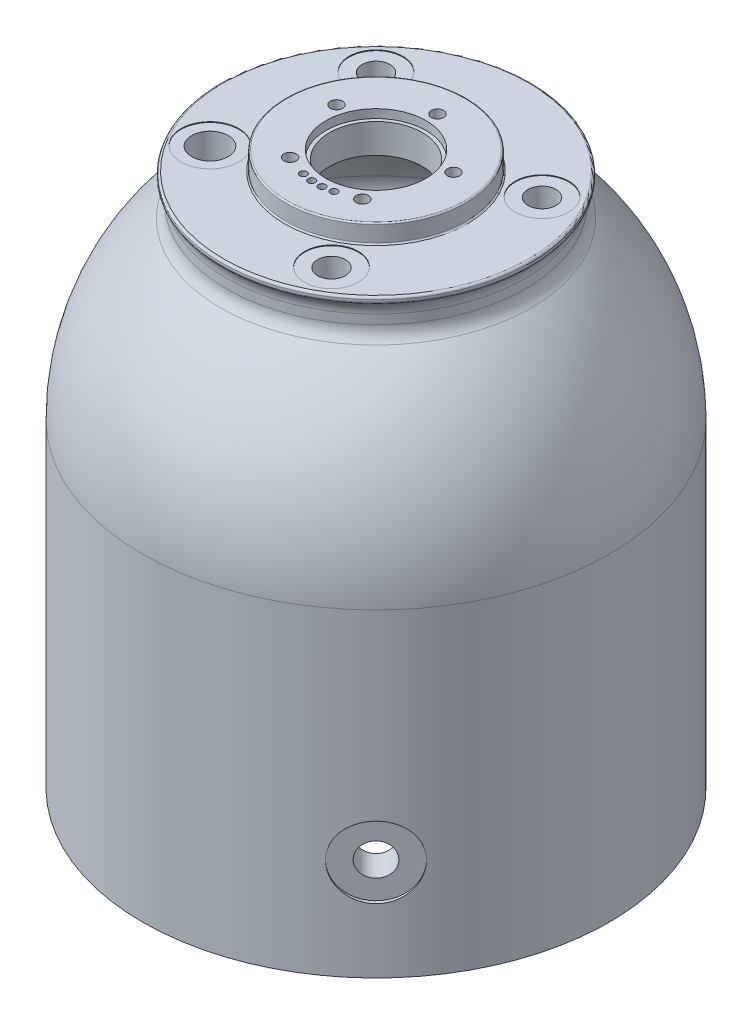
ISO-10303-21;
HEADER;
FILE_DESCRIPTION(('STEP AP214'),'2;1');
FILE_NAME('part.step','',(''),(''),'','','');
FILE_SCHEMA(('AUTOMOTIVE_DESIGN { 1 0 10303 214 1 1 1 1 }'));
ENDSEC;
DATA;
#1=APPLICATION_CONTEXT('core data for automotive mechanical design processes');
#2=APPLICATION_PROTOCOL_DEFINITION('international standard','automotive_design',2000,#1);
#3=PRODUCT_CONTEXT('',#1,'mechanical');
#4=PRODUCT('Part','Part','',(#3));
#5=PRODUCT_RELATED_PRODUCT_CATEGORY('part','',(#4));
#6=PRODUCT_DEFINITION_FORMATION('','',#4);
#7=PRODUCT_DEFINITION_CONTEXT('part definition',#1,'design');
#8=PRODUCT_DEFINITION('design','',#6,#7);
#9=PRODUCT_DEFINITION_SHAPE('','',#8);
#10=(LENGTH_UNIT() NAMED_UNIT(*) SI_UNIT(.MILLI.,.METRE.));
#11=(NAMED_UNIT(*) PLANE_ANGLE_UNIT() SI_UNIT($,.RADIAN.));
#12=(NAMED_UNIT(*) SI_UNIT($,.STERADIAN.) SOLID_ANGLE_UNIT());
#13=UNCERTAINTY_MEASURE_WITH_UNIT(LENGTH_MEASURE(1.E-05),#10,'distance_accuracy_value','');
#14=(GEOMETRIC_REPRESENTATION_CONTEXT(3) GLOBAL_UNCERTAINTY_ASSIGNED_CONTEXT((#13)) GLOBAL_UNIT_ASSIGNED_CONTEXT((#10,
#11,#12)) REPRESENTATION_CONTEXT('',''));
#15=CARTESIAN_POINT('',(0.,0.,0.));
#16=DIRECTION('',(0.,0.,1.));
#17=DIRECTION('',(1.,0.,0.));
#18=AXIS2_PLACEMENT_3D('',#15,#16,#17);
#19=CARTESIAN_POINT('',(82.9081399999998,38.735,82.9081400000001));
#20=DIRECTION('',(-0.707106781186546,0.,-0.707106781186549));
#21=DIRECTION('',(-0.707106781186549,0.,0.707106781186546));
#22=AXIS2_PLACEMENT_3D('',#19,#20,#21);
#23=CYLINDRICAL_SURFACE('',#22,5.7546875);
#24=CARTESIAN_POINT('',(45.931019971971,38.735,54.0693770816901));
#25=CARTESIAN_POINT('',(45.9310187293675,38.8963936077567,54.0693778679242));
#26=CARTESIAN_POINT('',(45.9362143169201,39.0577647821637,54.0649657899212));
#27=CARTESIAN_POINT('',(45.9569501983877,39.3794099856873,54.0473408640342));
#28=CARTESIAN_POINT('',(45.9724930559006,39.5396837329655,54.0341258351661));
#29=CARTESIAN_POINT('',(46.0138071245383,39.858070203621,53.9989483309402));
#30=CARTESIAN_POINT('',(46.0395868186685,40.0161810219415,53.9769786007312));
#31=CARTESIAN_POINT('',(46.1011579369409,40.3290423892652,53.9244008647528));
#32=CARTESIAN_POINT('',(46.1369530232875,40.4837916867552,53.8937896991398));
#33=CARTESIAN_POINT('',(46.21819949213,40.7886282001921,53.8241305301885));
#34=CARTESIAN_POINT('',(46.263641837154,40.938719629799,53.7850904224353));
#35=CARTESIAN_POINT('',(46.3638274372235,41.2333857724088,53.6987524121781));
#36=CARTESIAN_POINT('',(46.41857411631,41.3779584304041,53.6514514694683));
#37=CARTESIAN_POINT('',(46.5368522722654,41.6604262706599,53.5488901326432));
#38=CARTESIAN_POINT('',(46.6003785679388,41.7983253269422,53.4936344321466));
#39=CARTESIAN_POINT('',(46.7357274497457,42.0666179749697,53.3754249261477));
#40=CARTESIAN_POINT('',(46.8075530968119,42.1970087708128,53.3124682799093));
#41=CARTESIAN_POINT('',(46.9590164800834,42.449540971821,53.1791039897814));
#42=CARTESIAN_POINT('',(47.0386680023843,42.5716671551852,53.1086831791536));
#43=CARTESIAN_POINT('',(47.2050449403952,42.8065963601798,52.9608558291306));
#44=CARTESIAN_POINT('',(47.291772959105,42.9193959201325,52.8834467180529));
#45=CARTESIAN_POINT('',(47.4715374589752,43.134790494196,52.7221380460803));
#46=CARTESIAN_POINT('',(47.5645718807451,43.2373888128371,52.6382406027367));
#47=CARTESIAN_POINT('',(47.7562572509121,43.4317329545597,52.464395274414));
#48=CARTESIAN_POINT('',(47.8549102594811,43.5234747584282,52.3744451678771));
#49=CARTESIAN_POINT('',(48.0571155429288,43.6954965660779,52.1889702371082));
#50=CARTESIAN_POINT('',(48.1606726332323,43.7757649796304,52.0934399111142));
#51=CARTESIAN_POINT('',(48.3718119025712,43.924183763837,51.8974441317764));
#52=CARTESIAN_POINT('',(48.4793955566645,43.9923296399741,51.7969768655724));
#53=CARTESIAN_POINT('',(48.6976806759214,44.1159533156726,51.591805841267));
#54=CARTESIAN_POINT('',(48.8083809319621,44.1714359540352,51.4871037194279));
#55=CARTESIAN_POINT('',(49.0320879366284,44.2693819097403,51.27411068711));
#56=CARTESIAN_POINT('',(49.1450955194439,44.3118404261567,51.165818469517));
#57=CARTESIAN_POINT('',(49.4857060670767,44.4189559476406,50.837189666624));
#58=CARTESIAN_POINT('',(49.7156261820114,44.4637643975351,50.6124167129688));
#59=CARTESIAN_POINT('',(50.1743057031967,44.4987683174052,50.1577477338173));
#60=CARTESIAN_POINT('',(50.4030651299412,44.488964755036,49.9278517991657));
#61=CARTESIAN_POINT('',(50.8525707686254,44.415191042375,49.4699385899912));
#62=CARTESIAN_POINT('',(51.0733345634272,44.3513483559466,49.2419181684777));
#63=CARTESIAN_POINT('',(51.5014283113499,44.1714878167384,48.7940066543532));
#64=CARTESIAN_POINT('',(51.7087581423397,44.0554694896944,48.5741156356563));
#65=CARTESIAN_POINT('',(52.1049129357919,43.7744137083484,48.1489231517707));
#66=CARTESIAN_POINT('',(52.2937159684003,43.6093190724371,47.9436390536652));
#67=CARTESIAN_POINT('',(52.647932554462,43.2348372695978,47.554397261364));
#68=CARTESIAN_POINT('',(52.8133456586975,43.0254492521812,47.3704399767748));
#69=CARTESIAN_POINT('',(53.1173622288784,42.567606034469,47.0292934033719));
#70=CARTESIAN_POINT('',(53.2558871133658,42.3190400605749,46.8721827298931));
#71=CARTESIAN_POINT('',(53.5023981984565,41.7902829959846,46.590606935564));
#72=CARTESIAN_POINT('',(53.6103843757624,41.5100918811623,46.4661418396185));
#73=CARTESIAN_POINT('',(53.793446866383,40.9259609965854,46.2540909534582));
#74=CARTESIAN_POINT('',(53.8685194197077,40.6220185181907,46.1665093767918));
#75=CARTESIAN_POINT('',(53.9841008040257,39.9990493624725,46.0313042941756));
#76=CARTESIAN_POINT('',(54.024610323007,39.6800229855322,45.9836799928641));
#77=CARTESIAN_POINT('',(54.0701268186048,39.0369143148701,45.9301510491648));
#78=CARTESIAN_POINT('',(54.07523453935,38.7128490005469,45.9241280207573));
#79=CARTESIAN_POINT('',(54.0501048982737,38.0680072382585,45.9537012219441));
#80=CARTESIAN_POINT('',(54.0198678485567,37.7472307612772,45.9892970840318));
#81=CARTESIAN_POINT('',(53.9247644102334,37.1185163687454,46.1007724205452));
#82=CARTESIAN_POINT('',(53.8599452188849,36.8105615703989,46.1765969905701));
#83=CARTESIAN_POINT('',(53.6971022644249,36.2157094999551,46.3658585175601));
#84=CARTESIAN_POINT('',(53.5990779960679,35.9288125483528,46.4792960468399));
#85=CARTESIAN_POINT('',(53.3717018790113,35.3835107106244,46.7402125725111));
#86=CARTESIAN_POINT('',(53.2422799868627,35.125171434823,46.887767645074));
#87=CARTESIAN_POINT('',(52.9551127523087,34.6449812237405,47.2118514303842));
#88=CARTESIAN_POINT('',(52.7973669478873,34.4231308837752,47.3883806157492));
#89=CARTESIAN_POINT('',(52.4567941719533,34.0216873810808,47.7651064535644));
#90=CARTESIAN_POINT('',(52.2739090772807,33.8421948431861,47.9653577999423));
#91=CARTESIAN_POINT('',(51.8877623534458,33.5312539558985,48.3828167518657));
#92=CARTESIAN_POINT('',(51.6845009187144,33.3998051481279,48.6000241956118));
#93=CARTESIAN_POINT('',(51.2630748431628,33.1888498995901,49.0443365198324));
#94=CARTESIAN_POINT('',(51.0449284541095,33.1092810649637,49.2714291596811));
#95=CARTESIAN_POINT('',(50.5991882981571,33.0041637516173,49.7290661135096));
#96=CARTESIAN_POINT('',(50.371594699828,32.9786143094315,49.9596103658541));
#97=CARTESIAN_POINT('',(50.0285624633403,32.9812946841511,50.3023399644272));
#98=CARTESIAN_POINT('',(49.9140486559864,32.9889968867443,50.4159677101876));
#99=CARTESIAN_POINT('',(49.6851315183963,33.0179190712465,50.6415794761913));
#100=CARTESIAN_POINT('',(49.5707281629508,33.0391340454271,50.7535640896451));
#101=CARTESIAN_POINT('',(49.3428244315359,33.0949446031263,50.9751616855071));
#102=CARTESIAN_POINT('',(49.2293244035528,33.1295451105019,51.0847737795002));
#103=CARTESIAN_POINT('',(49.0041478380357,33.211858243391,51.3008183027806));
#104=CARTESIAN_POINT('',(48.8924706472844,33.2595660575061,51.4072518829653));
#105=CARTESIAN_POINT('',(48.671710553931,33.3677740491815,51.6163137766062));
#106=CARTESIAN_POINT('',(48.5626284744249,33.428278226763,51.7189408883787));
#107=CARTESIAN_POINT('',(48.3479714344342,33.5616122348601,51.919662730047));
#108=CARTESIAN_POINT('',(48.2423952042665,33.6344375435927,52.017759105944));
#109=CARTESIAN_POINT('',(48.0354935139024,33.7919385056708,52.2088818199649));
#110=CARTESIAN_POINT('',(47.9341695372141,33.8766182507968,52.3019063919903));
#111=CARTESIAN_POINT('',(47.7366461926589,34.0571760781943,52.4822505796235));
#112=CARTESIAN_POINT('',(47.6404449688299,34.1530500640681,52.5695722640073));
#113=CARTESIAN_POINT('',(47.4536046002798,34.3556605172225,52.7382919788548));
#114=CARTESIAN_POINT('',(47.3629836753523,34.4624298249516,52.8196707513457));
#115=CARTESIAN_POINT('',(47.1883995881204,34.6857863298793,52.9756999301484));
#116=CARTESIAN_POINT('',(47.1044339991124,34.8023699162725,53.0503527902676));
#117=CARTESIAN_POINT('',(46.9437653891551,35.0446415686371,53.192579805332));
#118=CARTESIAN_POINT('',(46.8670668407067,35.170335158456,53.2601496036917));
#119=CARTESIAN_POINT('',(46.7216574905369,35.4298293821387,53.3877533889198));
#120=CARTESIAN_POINT('',(46.6529437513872,35.5636270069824,53.4477901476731));
#121=CARTESIAN_POINT('',(46.5239115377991,35.8387269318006,53.5601449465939));
#122=CARTESIAN_POINT('',(46.463611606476,35.9800448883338,53.6124459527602));
#123=CARTESIAN_POINT('',(46.3521225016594,36.2688617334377,53.7088661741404));
#124=CARTESIAN_POINT('',(46.3009299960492,36.4163583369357,53.752988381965));
#125=CARTESIAN_POINT('',(46.2081118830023,36.7164096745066,53.8327992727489));
#126=CARTESIAN_POINT('',(46.1664782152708,36.8689600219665,53.8684950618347));
#127=CARTESIAN_POINT('',(46.0930970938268,37.1780975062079,53.9312976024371));
#128=CARTESIAN_POINT('',(46.061347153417,37.3346836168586,53.9584065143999));
#129=CARTESIAN_POINT('',(46.000296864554,37.696492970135,54.0104702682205));
#130=CARTESIAN_POINT('',(45.9743477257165,37.9027112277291,54.0325457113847));
#131=CARTESIAN_POINT('',(45.9397101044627,38.3176321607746,54.0619985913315));
#132=CARTESIAN_POINT('',(45.9310215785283,38.5263348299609,54.0693760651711));
#133=CARTESIAN_POINT('',(45.931019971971,38.735,54.0693770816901));
#134=B_SPLINE_CURVE_WITH_KNOTS('',3,(#24,#25,#26,#27,#28,#29,#30,#31,#32,#33,#34,#35,#36,#37,
#38,#39,#40,#41,#42,#43,#44,#45,#46,#47,#48,#49,#50,#51,#52,#53,#54,#55,#56,#57,#58,#59,#60,#61,
#62,#63,#64,#65,#66,#67,#68,#69,#70,#71,#72,#73,#74,#75,#76,#77,#78,#79,#80,#81,#82,#83,#84,#85,
#86,#87,#88,#89,#90,#91,#92,#93,#94,#95,#96,#97,#98,#99,#100,#101,#102,#103,#104,#105,#106,#107,
#108,#109,#110,#111,#112,#113,#114,#115,#116,#117,#118,#119,#120,#121,#122,#123,#124,#125,#126,
#127,#128,#129,#130,#131,#132,#133),.UNSPECIFIED.,.T.,.F.,(4,2,2,2,2,2,2,2,2,2,2,2,2,2,2,2,2,2,
2,2,2,2,2,2,2,2,2,2,2,2,2,2,2,2,2,2,2,2,2,2,2,2,2,2,2,2,2,2,2,2,2,2,2,2,4),(0.,
0.483998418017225,0.968116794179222,1.45263718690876,1.93733498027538,2.42158070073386,
2.9060050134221,3.39014465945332,3.87446343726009,4.35965123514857,4.84501831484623,
5.33022765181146,5.8156160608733,6.30149138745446,6.78754648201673,7.27341553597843,
7.75946347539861,8.72835628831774,9.69723193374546,10.6638286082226,11.6304340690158,
12.5981702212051,13.5659249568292,14.5364667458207,15.5070092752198,16.4776626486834,
17.4482967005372,18.4161674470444,19.3840296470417,20.3505742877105,21.3171336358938,
22.2858693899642,23.2546209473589,24.2256512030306,25.1966721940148,26.1665232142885,
27.1363569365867,27.6204023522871,28.1042684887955,28.5883127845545,29.072179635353,
29.5561979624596,30.040039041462,30.5240475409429,31.0078794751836,31.4932154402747,
31.9783736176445,32.4638284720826,32.9491041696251,33.435433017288,33.9215835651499,
34.4073226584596,34.8929394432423,35.5187007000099,36.1444603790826),.UNSPECIFIED.);
#135=CARTESIAN_POINT('',(45.931019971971,38.735,54.0693770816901));
#136=VERTEX_POINT('',#135);
#137=EDGE_CURVE('E162',#136,#136,#134,.T.);
#138=ORIENTED_EDGE('',*,*,#137,.T.);
#139=EDGE_LOOP('',(#138));
#140=FACE_BOUND('',#139,.T.);
#141=CARTESIAN_POINT('',(57.7268823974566,38.735,57.7268823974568));
#142=DIRECTION('',(0.707106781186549,0.,0.707106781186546));
#143=DIRECTION('',(0.707106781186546,0.,-0.707106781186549));
#144=AXIS2_PLACEMENT_3D('',#141,#142,#143);
#145=CIRCLE('',#144,5.7546875);
#146=CARTESIAN_POINT('',(61.7960609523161,38.735,53.6577038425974));
#147=VERTEX_POINT('',#146);
#148=EDGE_CURVE('E169',#147,#147,#145,.T.);
#149=ORIENTED_EDGE('',*,*,#148,.T.);
#150=EDGE_LOOP('',(#149));
#151=FACE_BOUND('',#150,.T.);
#152=ADVANCED_FACE('F33',(#140,#151),#23,.F.);
#153=CARTESIAN_POINT('',(0.,0.,0.));
#154=DIRECTION('',(0.,-1.,0.));
#155=DIRECTION('',(0.,0.,-1.));
#156=AXIS2_PLACEMENT_3D('',#153,#154,#155);
#157=CYLINDRICAL_SURFACE('',#156,82.90814);
#158=CARTESIAN_POINT('',(0.,116.41074,0.));
#159=DIRECTION('',(0.,-1.,0.));
#160=DIRECTION('',(0.,0.,-1.));
#161=AXIS2_PLACEMENT_3D('',#158,#159,#160);
#162=CIRCLE('',#161,82.90814);
#163=CARTESIAN_POINT('',(0.,116.41074,-82.90814));
#164=VERTEX_POINT('',#163);
#165=EDGE_CURVE('E380',#164,#164,#162,.T.);
#166=ORIENTED_EDGE('',*,*,#165,.T.);
#167=EDGE_LOOP('',(#166));
#168=FACE_BOUND('',#167,.T.);
#169=CARTESIAN_POINT('',(0.,3.17499999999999,0.));
#170=DIRECTION('',(0.,-1.,0.));
#171=DIRECTION('',(0.,0.,-1.));
#172=AXIS2_PLACEMENT_3D('',#169,#170,#171);
#173=CIRCLE('',#172,82.90814);
#174=CARTESIAN_POINT('',(0.,3.17499999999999,-82.90814));
#175=VERTEX_POINT('',#174);
#176=EDGE_CURVE('E383',#175,#175,#173,.T.);
#177=ORIENTED_EDGE('',*,*,#176,.F.);
#178=EDGE_LOOP('',(#177));
#179=FACE_BOUND('',#178,.T.);
#180=CARTESIAN_POINT('',(66.9132764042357,38.735,48.9527641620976));
#181=CARTESIAN_POINT('',(66.9132784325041,38.3804473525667,48.9527591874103));
#182=CARTESIAN_POINT('',(66.9044049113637,38.0259635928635,48.9648968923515));
#183=CARTESIAN_POINT('',(66.8689451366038,37.3194293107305,49.0133125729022));
#184=CARTESIAN_POINT('',(66.8423551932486,36.9673793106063,49.0495955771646));
#185=CARTESIAN_POINT('',(66.7715253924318,36.2680514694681,49.1459726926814));
#186=CARTESIAN_POINT('',(66.7272704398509,35.9207779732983,49.2060871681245));
#187=CARTESIAN_POINT('',(66.6212765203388,35.2337671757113,49.3494998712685));
#188=CARTESIAN_POINT('',(66.5595375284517,34.8940298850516,49.4327981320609));
#189=CARTESIAN_POINT('',(66.4188619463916,34.224753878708,49.621651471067));
#190=CARTESIAN_POINT('',(66.339939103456,33.8952072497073,49.7271887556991));
#191=CARTESIAN_POINT('',(66.1651611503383,33.2483155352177,49.9595060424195));
#192=CARTESIAN_POINT('',(66.0693058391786,32.9309705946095,50.0862862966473));
#193=CARTESIAN_POINT('',(65.8610405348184,32.3107159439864,50.3598306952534));
#194=CARTESIAN_POINT('',(65.7486330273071,32.0078040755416,50.5065918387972));
#195=CARTESIAN_POINT('',(65.5076834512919,31.4184295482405,50.8187164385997));
#196=CARTESIAN_POINT('',(65.3791413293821,31.1319669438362,50.9840799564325));
#197=CARTESIAN_POINT('',(65.105408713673,30.5753624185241,51.3331762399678));
#198=CARTESIAN_POINT('',(64.9601010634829,30.3053583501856,51.5170369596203));
#199=CARTESIAN_POINT('',(64.6542231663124,29.785876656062,51.9003971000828));
#200=CARTESIAN_POINT('',(64.4936528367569,29.5363991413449,52.0998966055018));
#201=CARTESIAN_POINT('',(64.1579364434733,29.0596827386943,52.5127569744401));
#202=CARTESIAN_POINT('',(63.9827895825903,28.8324450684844,52.7261185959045));
#203=CARTESIAN_POINT('',(63.6187291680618,28.4018098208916,53.1648211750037));
#204=CARTESIAN_POINT('',(63.4298155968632,28.1984122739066,53.3901621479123));
#205=CARTESIAN_POINT('',(63.0381555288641,27.8159357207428,53.8520450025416));
#206=CARTESIAN_POINT('',(62.8353442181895,27.6369842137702,54.0886375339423));
#207=CARTESIAN_POINT('',(62.4178028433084,27.3059157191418,54.5699464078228));
#208=CARTESIAN_POINT('',(62.2030727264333,27.153798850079,54.8146627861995));
#209=CARTESIAN_POINT('',(61.7629024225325,26.8775323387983,55.3101560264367));
#210=CARTESIAN_POINT('',(61.5374626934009,26.7533815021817,55.5609326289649));
#211=CARTESIAN_POINT('',(61.0772067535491,26.5339758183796,56.0664902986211));
#212=CARTESIAN_POINT('',(60.8423906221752,26.4387207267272,56.3212713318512));
#213=CARTESIAN_POINT('',(60.3667329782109,26.2784650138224,56.8307815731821));
#214=CARTESIAN_POINT('',(60.1259529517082,26.2132336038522,57.0854956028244));
#215=CARTESIAN_POINT('',(59.6382031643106,26.1124325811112,57.5948672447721));
#216=CARTESIAN_POINT('',(59.3912334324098,26.076862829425,57.8495248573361));
#217=CARTESIAN_POINT('',(58.8928193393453,26.035660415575,58.3568500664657));
#218=CARTESIAN_POINT('',(58.6413752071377,26.0300262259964,58.6095177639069));
#219=CARTESIAN_POINT('',(58.1358082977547,26.0487345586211,59.1110332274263));
#220=CARTESIAN_POINT('',(57.8816855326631,26.0730769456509,59.3598810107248));
#221=CARTESIAN_POINT('',(57.3747912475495,26.1512201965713,59.8499477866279));
#222=CARTESIAN_POINT('',(57.1220262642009,26.2047723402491,60.091213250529));
#223=CARTESIAN_POINT('',(56.6176340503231,26.3407619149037,60.5666848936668));
#224=CARTESIAN_POINT('',(56.3660068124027,26.4231991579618,60.8008911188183));
#225=CARTESIAN_POINT('',(55.8658322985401,26.6163456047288,61.2607859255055));
#226=CARTESIAN_POINT('',(55.6172850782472,26.727055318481,61.4864743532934));
#227=CARTESIAN_POINT('',(55.1252387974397,26.9759327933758,61.9279985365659));
#228=CARTESIAN_POINT('',(54.8817397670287,27.1141007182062,62.1438342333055));
#229=CARTESIAN_POINT('',(54.4008101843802,27.4174910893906,62.5652792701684));
#230=CARTESIAN_POINT('',(54.1634071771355,27.5828175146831,62.7708451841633));
#231=CARTESIAN_POINT('',(53.6976278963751,27.9389573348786,63.169759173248));
#232=CARTESIAN_POINT('',(53.4692516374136,28.1297707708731,63.3631072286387));
#233=CARTESIAN_POINT('',(53.0234328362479,28.5355568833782,63.7366444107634));
#234=CARTESIAN_POINT('',(52.8059909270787,28.7505309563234,63.9168327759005));
#235=CARTESIAN_POINT('',(52.3839169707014,29.2031432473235,64.26320463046));
#236=CARTESIAN_POINT('',(52.1792850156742,29.4407816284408,64.4293880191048));
#237=CARTESIAN_POINT('',(51.7825939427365,29.9396472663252,64.7486536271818));
#238=CARTESIAN_POINT('',(51.5906854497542,30.201091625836,64.9015838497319));
#239=CARTESIAN_POINT('',(51.2235215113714,30.7436427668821,65.1917578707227));
#240=CARTESIAN_POINT('',(51.0482661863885,31.02474969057,65.3290015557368));
#241=CARTESIAN_POINT('',(50.7160472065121,31.6046829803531,65.5872435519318));
#242=CARTESIAN_POINT('',(50.5590837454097,31.9035095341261,65.7082416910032));
#243=CARTESIAN_POINT('',(50.2649581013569,32.5168038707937,65.9335119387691));
#244=CARTESIAN_POINT('',(50.127795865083,32.8312716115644,66.0377840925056));
#245=CARTESIAN_POINT('',(49.8745159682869,33.4739234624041,66.2292803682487));
#246=CARTESIAN_POINT('',(49.7584162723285,33.8021189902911,66.3164899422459));
#247=CARTESIAN_POINT('',(49.5485797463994,34.4696553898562,66.4734165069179));
#248=CARTESIAN_POINT('',(49.4548429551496,34.8089962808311,66.5431334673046));
#249=CARTESIAN_POINT('',(49.2907077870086,35.4963746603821,66.6648051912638));
#250=CARTESIAN_POINT('',(49.2203080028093,35.844411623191,66.7167610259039));
#251=CARTESIAN_POINT('',(49.1035823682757,36.5466842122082,66.802718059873));
#252=CARTESIAN_POINT('',(49.0572562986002,36.9009197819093,66.8367194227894));
#253=CARTESIAN_POINT('',(48.9895170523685,37.6094054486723,66.8863860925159));
#254=CARTESIAN_POINT('',(48.9678567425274,37.9636191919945,66.9022333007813));
#255=CARTESIAN_POINT('',(48.948838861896,38.673045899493,66.9161489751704));
#256=CARTESIAN_POINT('',(48.951481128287,39.028258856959,66.9142175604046));
#257=CARTESIAN_POINT('',(48.9810397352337,39.7371183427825,66.8925837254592));
#258=CARTESIAN_POINT('',(49.0079553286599,40.0907649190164,66.8728818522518));
#259=CARTESIAN_POINT('',(49.0857753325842,40.7939652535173,66.815781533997));
#260=CARTESIAN_POINT('',(49.1366797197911,41.1435190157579,66.7783831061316));
#261=CARTESIAN_POINT('',(49.2616149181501,41.8342177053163,66.686272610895));
#262=CARTESIAN_POINT('',(49.3355227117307,42.1753971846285,66.6316526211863));
#263=CARTESIAN_POINT('',(49.50579441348,42.8488518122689,66.5052421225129));
#264=CARTESIAN_POINT('',(49.6021582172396,43.1811270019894,66.4334516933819));
#265=CARTESIAN_POINT('',(49.8163831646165,43.8344879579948,66.2729624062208));
#266=CARTESIAN_POINT('',(49.934245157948,44.1555732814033,66.1842628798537));
#267=CARTESIAN_POINT('',(50.1903129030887,44.7843446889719,65.9902868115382));
#268=CARTESIAN_POINT('',(50.3285188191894,45.0920306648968,65.8850101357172));
#269=CARTESIAN_POINT('',(50.6251163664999,45.6942686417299,65.6573870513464));
#270=CARTESIAN_POINT('',(50.7836577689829,45.9886987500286,65.5349132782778));
#271=CARTESIAN_POINT('',(51.1185712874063,46.559812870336,65.2740100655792));
#272=CARTESIAN_POINT('',(51.2949434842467,46.8364968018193,65.1355805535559));
#273=CARTESIAN_POINT('',(51.663905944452,47.3702434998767,64.8433178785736));
#274=CARTESIAN_POINT('',(51.8564970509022,47.6273052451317,64.6894839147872));
#275=CARTESIAN_POINT('',(52.2561603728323,48.1200330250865,64.3670667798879));
#276=CARTESIAN_POINT('',(52.4632326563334,48.3556989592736,64.1984835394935));
#277=CARTESIAN_POINT('',(52.8919026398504,48.8059660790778,63.8457829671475));
#278=CARTESIAN_POINT('',(53.1136112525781,49.0203656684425,63.6615430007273));
#279=CARTESIAN_POINT('',(53.5679732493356,49.4242187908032,63.2796963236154));
#280=CARTESIAN_POINT('',(53.8006267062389,49.6136721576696,63.0820895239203));
#281=CARTESIAN_POINT('',(54.2748739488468,49.9662620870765,62.6745201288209));
#282=CARTESIAN_POINT('',(54.5164675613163,50.1293991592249,62.4645577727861));
#283=CARTESIAN_POINT('',(55.0065587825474,50.4281619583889,62.0334157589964));
#284=CARTESIAN_POINT('',(55.2550563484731,50.5637878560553,61.8122361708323));
#285=CARTESIAN_POINT('',(55.755935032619,50.8060500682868,61.3608067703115));
#286=CARTESIAN_POINT('',(56.0082976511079,50.9127953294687,61.1305949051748));
#287=CARTESIAN_POINT('',(56.5157935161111,51.0971726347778,60.66171856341));
#288=CARTESIAN_POINT('',(56.770926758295,51.1748047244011,60.4230540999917));
#289=CARTESIAN_POINT('',(57.2819342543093,51.3003567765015,59.9388319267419));
#290=CARTESIAN_POINT('',(57.5378084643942,51.348278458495,59.6932746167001));
#291=CARTESIAN_POINT('',(58.0483434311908,51.4140449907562,59.1969276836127));
#292=CARTESIAN_POINT('',(58.3030041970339,51.4318900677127,58.9461381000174));
#293=CARTESIAN_POINT('',(58.8066206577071,51.4373373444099,58.4437017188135));
#294=CARTESIAN_POINT('',(59.0556080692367,51.4252473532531,58.1920899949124));
#295=CARTESIAN_POINT('',(59.5487826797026,51.3715612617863,57.687318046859));
#296=CARTESIAN_POINT('',(59.7929699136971,51.329965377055,57.4341578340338));
#297=CARTESIAN_POINT('',(60.2748979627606,51.2175843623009,56.9281865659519));
#298=CARTESIAN_POINT('',(60.5126388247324,51.1467994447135,56.6753755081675));
#299=CARTESIAN_POINT('',(60.9801525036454,50.976573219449,56.1720452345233));
#300=CARTESIAN_POINT('',(61.2099252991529,50.8771318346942,55.9215260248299));
#301=CARTESIAN_POINT('',(61.6599262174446,50.6504228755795,55.4249525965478));
#302=CARTESIAN_POINT('',(61.8801618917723,50.5231778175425,55.1788949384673));
#303=CARTESIAN_POINT('',(62.3100287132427,50.2417429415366,54.6930089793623));
#304=CARTESIAN_POINT('',(62.5196598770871,50.0875531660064,54.4531806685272));
#305=CARTESIAN_POINT('',(62.9271998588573,49.7533284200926,53.981703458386));
#306=CARTESIAN_POINT('',(63.1251084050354,49.5732928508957,53.7500547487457));
#307=CARTESIAN_POINT('',(63.5082042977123,49.1886442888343,53.2968640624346));
#308=CARTESIAN_POINT('',(63.6933915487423,48.9840311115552,53.0753221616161));
#309=CARTESIAN_POINT('',(64.0519099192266,48.5495334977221,52.6421157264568));
#310=CARTESIAN_POINT('',(64.2251078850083,48.3194221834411,52.4305685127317));
#311=CARTESIAN_POINT('',(64.5568561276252,47.837183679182,52.0215471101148));
#312=CARTESIAN_POINT('',(64.7154062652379,47.5850562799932,51.8240730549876));
#313=CARTESIAN_POINT('',(65.0172115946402,47.0604638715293,51.4449279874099));
#314=CARTESIAN_POINT('',(65.160463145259,46.7879940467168,51.263260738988));
#315=CARTESIAN_POINT('',(65.4310366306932,46.2246475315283,50.9174561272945));
#316=CARTESIAN_POINT('',(65.5583587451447,45.9337710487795,50.753318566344));
#317=CARTESIAN_POINT('',(65.7972731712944,45.333842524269,50.4432064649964));
#318=CARTESIAN_POINT('',(65.9087682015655,45.024693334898,50.2973448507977));
#319=CARTESIAN_POINT('',(66.1146921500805,44.3919619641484,50.0263543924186));
#320=CARTESIAN_POINT('',(66.2091210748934,44.0683797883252,49.901225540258));
#321=CARTESIAN_POINT('',(66.3804711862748,43.4093585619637,49.6730619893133));
#322=CARTESIAN_POINT('',(66.4574082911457,43.0739306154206,49.5700072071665));
#323=CARTESIAN_POINT('',(66.5935713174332,42.3934537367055,49.3869305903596));
#324=CARTESIAN_POINT('',(66.6528011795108,42.0484069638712,49.306903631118));
#325=CARTESIAN_POINT('',(66.7729595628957,41.2150142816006,49.1441315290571));
#326=CARTESIAN_POINT('',(66.825552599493,40.723232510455,49.0724837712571));
#327=CARTESIAN_POINT('',(66.8957093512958,39.7325883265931,48.9768039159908));
#328=CARTESIAN_POINT('',(66.9132735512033,39.2337260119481,48.9527711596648));
#329=CARTESIAN_POINT('',(66.9132764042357,38.735,48.9527641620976));
#330=B_SPLINE_CURVE_WITH_KNOTS('',3,(#180,#181,#182,#183,#184,#185,#186,#187,#188,#189,#190,
#191,#192,#193,#194,#195,#196,#197,#198,#199,#200,#201,#202,#203,#204,#205,#206,#207,#208,#209,
#210,#211,#212,#213,#214,#215,#216,#217,#218,#219,#220,#221,#222,#223,#224,#225,#226,#227,#228,
#229,#230,#231,#232,#233,#234,#235,#236,#237,#238,#239,#240,#241,#242,#243,#244,#245,#246,#247,
#248,#249,#250,#251,#252,#253,#254,#255,#256,#257,#258,#259,#260,#261,#262,#263,#264,#265,#266,
#267,#268,#269,#270,#271,#272,#273,#274,#275,#276,#277,#278,#279,#280,#281,#282,#283,#284,#285,
#286,#287,#288,#289,#290,#291,#292,#293,#294,#295,#296,#297,#298,#299,#300,#301,#302,#303,#304,
#305,#306,#307,#308,#309,#310,#311,#312,#313,#314,#315,#316,#317,#318,#319,#320,#321,#322,#323,
#324,#325,#326,#327,#328,#329),.UNSPECIFIED.,.T.,.F.,(4,2,2,2,2,2,2,2,2,2,2,2,2,2,2,2,2,2,2,2,2,
2,2,2,2,2,2,2,2,2,2,2,2,2,2,2,2,2,2,2,2,2,2,2,2,2,2,2,2,2,2,2,2,2,2,2,2,2,2,2,2,2,2,2,2,2,2,2,2,
2,2,2,2,2,4),(0.,1.06322088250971,2.12666326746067,3.19101633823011,4.25537092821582,
5.31887713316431,6.38239596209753,7.44575524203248,8.50911804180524,9.58042169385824,
10.6517311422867,11.7230992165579,12.7944686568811,13.8712283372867,14.9479927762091,
16.0247112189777,17.1014205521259,18.169709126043,19.2379926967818,20.3062217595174,
21.3744460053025,22.4337132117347,23.4929735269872,24.5522529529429,25.61153869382,
26.6749788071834,27.7384206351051,28.8019239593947,29.8654349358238,30.939863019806,
32.0142988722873,33.0887461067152,34.1631904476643,35.2385469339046,36.3139052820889,
37.3891987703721,38.4644824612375,39.5288950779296,40.593300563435,41.6576732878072,
42.7220449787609,43.7808196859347,44.8395894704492,45.8984011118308,46.9572213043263,
48.024343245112,49.0914700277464,50.1586523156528,51.2258396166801,52.3023324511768,
53.3788324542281,54.4553116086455,55.5317840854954,56.6041372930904,57.6764888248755,
58.7487782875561,59.821059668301,60.8823611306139,61.9436548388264,63.0049408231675,
64.0662296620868,65.126662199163,66.1870930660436,67.247548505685,68.3080119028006,
69.3788115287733,70.4496213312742,71.5206854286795,72.591737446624,73.669111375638,
74.7464848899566,75.8228739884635,76.8990233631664,78.3946073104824,79.8901705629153),.UNSPECIFIED.);
#331=CARTESIAN_POINT('',(66.9132764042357,38.735,48.9527641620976));
#332=VERTEX_POINT('',#331);
#333=EDGE_CURVE('E10',#332,#332,#330,.T.);
#334=ORIENTED_EDGE('',*,*,#333,.T.);
#335=EDGE_LOOP('',(#334));
#336=FACE_BOUND('',#335,.T.);
#337=ADVANCED_FACE('F159',(#168,#179,#336),#157,.T.);
#338=CARTESIAN_POINT('',(0.,0.,0.));
#339=DIRECTION('',(0.,-1.,0.));
#340=DIRECTION('',(0.,0.,-1.));
#341=AXIS2_PLACEMENT_3D('',#338,#339,#340);
#342=CYLINDRICAL_SURFACE('',#341,70.94474);
#343=CARTESIAN_POINT('',(0.,14.69644,0.));
#344=DIRECTION('',(0.,-1.,0.));
#345=DIRECTION('',(0.,0.,-1.));
#346=AXIS2_PLACEMENT_3D('',#343,#344,#345);
#347=CIRCLE('',#346,70.94474);
#348=CARTESIAN_POINT('',(0.,14.69644,-70.94474));
#349=VERTEX_POINT('',#348);
#350=EDGE_CURVE('E332',#349,#349,#347,.T.);
#351=ORIENTED_EDGE('',*,*,#350,.T.);
#352=EDGE_LOOP('',(#351));
#353=FACE_BOUND('',#352,.T.);
#354=CARTESIAN_POINT('',(0.,126.69774,0.));
#355=DIRECTION('',(0.,-1.,0.));
#356=DIRECTION('',(0.,0.,-1.));
#357=AXIS2_PLACEMENT_3D('',#354,#355,#356);
#358=CIRCLE('',#357,70.94474);
#359=CARTESIAN_POINT('',(0.,126.69774,-70.94474));
#360=VERTEX_POINT('',#359);
#361=EDGE_CURVE('E335',#360,#360,#358,.T.);
#362=ORIENTED_EDGE('',*,*,#361,.F.);
#363=EDGE_LOOP('',(#362));
#364=FACE_BOUND('',#363,.T.);
#365=ORIENTED_EDGE('',*,*,#137,.F.);
#366=EDGE_LOOP('',(#365));
#367=FACE_BOUND('',#366,.T.);
#368=ADVANCED_FACE('F154',(#353,#364,#367),#342,.F.);
#369=CARTESIAN_POINT('',(-37.394976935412,142.05204,21.59));
#370=DIRECTION('',(0.,1.,0.));
#371=DIRECTION('',(0.,0.,1.));
#372=AXIS2_PLACEMENT_3D('',#369,#370,#371);
#373=CYLINDRICAL_SURFACE('',#372,6.5024);
#374=CARTESIAN_POINT('',(-43.4306342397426,176.017607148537,19.1708996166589));
#375=CARTESIAN_POINT('',(-43.5576697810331,175.8231024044,19.4878822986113));
#376=CARTESIAN_POINT('',(-43.6616935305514,175.636635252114,19.81987845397));
#377=CARTESIAN_POINT('',(-43.7776890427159,175.37462148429,20.3356408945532));
#378=CARTESIAN_POINT('',(-43.8096932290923,175.290152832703,20.5107142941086));
#379=CARTESIAN_POINT('',(-43.8594242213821,175.128086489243,20.8659641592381));
#380=CARTESIAN_POINT('',(-43.8771598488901,175.050484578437,21.0461374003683));
#381=CARTESIAN_POINT('',(-43.8959396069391,174.91424307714,21.3831986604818));
#382=CARTESIAN_POINT('',(-43.8990870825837,174.854504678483,21.5395291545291));
#383=CARTESIAN_POINT('',(-43.8939095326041,174.741448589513,21.8542521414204));
#384=CARTESIAN_POINT('',(-43.8855898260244,174.688127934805,22.0126436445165));
#385=CARTESIAN_POINT('',(-43.857039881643,174.588592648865,22.3305466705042));
#386=CARTESIAN_POINT('',(-43.8368130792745,174.542375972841,22.4900578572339));
#387=CARTESIAN_POINT('',(-43.7841241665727,174.457731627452,22.8090666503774));
#388=CARTESIAN_POINT('',(-43.7516674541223,174.419300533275,22.9685642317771));
#389=CARTESIAN_POINT('',(-43.6740706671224,174.35060485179,23.2874365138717));
#390=CARTESIAN_POINT('',(-43.6288463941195,174.32039718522,23.4468031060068));
#391=CARTESIAN_POINT('',(-43.5258197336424,174.269047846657,23.7629256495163));
#392=CARTESIAN_POINT('',(-43.4680172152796,174.247906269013,23.9196815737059));
#393=CARTESIAN_POINT('',(-43.3401103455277,174.215111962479,24.2290530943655));
#394=CARTESIAN_POINT('',(-43.2700105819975,174.203455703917,24.381670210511));
#395=CARTESIAN_POINT('',(-43.1180006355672,174.189861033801,24.6813467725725));
#396=CARTESIAN_POINT('',(-43.0360916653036,174.187921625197,24.8284067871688));
#397=CARTESIAN_POINT('',(-42.8708307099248,174.193472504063,25.0997909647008));
#398=CARTESIAN_POINT('',(-42.788626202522,174.199950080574,25.2248378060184));
#399=CARTESIAN_POINT('',(-42.61608773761,174.220526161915,25.4685962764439));
#400=CARTESIAN_POINT('',(-42.5257510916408,174.234627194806,25.5873057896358));
#401=CARTESIAN_POINT('',(-42.3377797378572,174.270218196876,25.8175267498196));
#402=CARTESIAN_POINT('',(-42.2401483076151,174.291704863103,25.9290413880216));
#403=CARTESIAN_POINT('',(-42.0383391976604,174.341749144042,26.1443579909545));
#404=CARTESIAN_POINT('',(-41.9341590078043,174.370309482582,26.248156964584));
#405=CARTESIAN_POINT('',(-41.7200261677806,174.434124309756,26.4476313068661));
#406=CARTESIAN_POINT('',(-41.6100679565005,174.469385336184,26.5432986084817));
#407=CARTESIAN_POINT('',(-41.3853066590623,174.546122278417,26.726096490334));
#408=CARTESIAN_POINT('',(-41.2705018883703,174.587600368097,26.8132240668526));
#409=CARTESIAN_POINT('',(-40.9200922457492,174.720618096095,27.0614333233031));
#410=CARTESIAN_POINT('',(-40.678361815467,174.820780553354,27.2094616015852));
#411=CARTESIAN_POINT('',(-40.1544004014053,175.053491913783,27.4862018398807));
#412=CARTESIAN_POINT('',(-39.8708513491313,175.188511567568,27.6102797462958));
#413=CARTESIAN_POINT('',(-39.2977166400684,175.477144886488,27.8152321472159));
#414=CARTESIAN_POINT('',(-39.0081275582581,175.630769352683,27.8960813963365));
#415=CARTESIAN_POINT('',(-38.3740526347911,175.982147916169,28.0278679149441));
#416=CARTESIAN_POINT('',(-38.0294204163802,176.182783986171,28.070392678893));
#417=CARTESIAN_POINT('',(-37.346069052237,176.597718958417,28.1012188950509));
#418=CARTESIAN_POINT('',(-37.0073538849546,176.812026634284,28.0894851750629));
#419=CARTESIAN_POINT('',(-36.2789298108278,177.29028780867,28.008243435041));
#420=CARTESIAN_POINT('',(-35.8915368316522,177.556028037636,27.9283368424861));
#421=CARTESIAN_POINT('',(-35.1406622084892,178.092884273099,27.7017274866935));
#422=CARTESIAN_POINT('',(-34.7771951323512,178.364003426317,27.5549844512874));
#423=CARTESIAN_POINT('',(-34.0408847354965,178.937401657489,27.1776630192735));
#424=CARTESIAN_POINT('',(-33.6719634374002,179.239596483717,26.9392562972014));
#425=CARTESIAN_POINT('',(-32.9845895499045,179.835194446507,26.3882859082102));
#426=CARTESIAN_POINT('',(-32.6661713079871,180.12859149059,26.075672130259));
#427=CARTESIAN_POINT('',(-32.2378485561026,180.55388010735,25.5567759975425));
#428=CARTESIAN_POINT('',(-32.103533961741,180.692884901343,25.3759346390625));
#429=CARTESIAN_POINT('',(-31.8526581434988,180.965131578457,24.998120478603));
#430=CARTESIAN_POINT('',(-31.7360989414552,181.098372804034,24.8011458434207));
#431=CARTESIAN_POINT('',(-31.5230369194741,181.357368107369,24.3925933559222));
#432=CARTESIAN_POINT('',(-31.426498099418,181.483135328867,24.1810426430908));
#433=CARTESIAN_POINT('',(-31.2553973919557,181.72585016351,23.7444547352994));
#434=CARTESIAN_POINT('',(-31.1808253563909,181.842801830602,23.5194238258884));
#435=CARTESIAN_POINT('',(-31.0748628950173,182.032219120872,23.1278900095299));
#436=CARTESIAN_POINT('',(-31.03723622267,182.107408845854,22.9643658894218));
#437=CARTESIAN_POINT('',(-30.9744652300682,182.252044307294,22.6324684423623));
#438=CARTESIAN_POINT('',(-30.9493178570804,182.321491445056,22.4640963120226));
#439=CARTESIAN_POINT('',(-30.9122294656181,182.453984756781,22.123428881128));
#440=CARTESIAN_POINT('',(-30.9002872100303,182.517031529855,21.9511339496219));
#441=CARTESIAN_POINT('',(-30.8902721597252,182.636025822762,21.6037869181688));
#442=CARTESIAN_POINT('',(-30.8921926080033,182.691976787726,21.4287362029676));
#443=CARTESIAN_POINT('',(-30.9105160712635,182.79652332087,21.0757736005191));
#444=CARTESIAN_POINT('',(-30.9270257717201,182.845061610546,20.8978501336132));
#445=CARTESIAN_POINT('',(-30.9750796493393,182.933600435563,20.5419816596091));
#446=CARTESIAN_POINT('',(-31.0066166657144,182.973605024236,20.3640367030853));
#447=CARTESIAN_POINT('',(-31.084917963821,183.044496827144,20.0097252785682));
#448=CARTESIAN_POINT('',(-31.1316781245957,183.075386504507,19.8333583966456));
#449=CARTESIAN_POINT('',(-31.2403784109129,183.127559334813,19.4839160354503));
#450=CARTESIAN_POINT('',(-31.3023164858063,183.14884378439,19.3108401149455));
#451=CARTESIAN_POINT('',(-31.4328688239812,183.179530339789,18.989831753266));
#452=CARTESIAN_POINT('',(-31.4998430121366,183.190034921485,18.8413348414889));
#453=CARTESIAN_POINT('',(-31.6449137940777,183.203141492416,18.5495194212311));
#454=CARTESIAN_POINT('',(-31.7230095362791,183.20574408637,18.4062005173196));
#455=CARTESIAN_POINT('',(-31.8896960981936,183.203010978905,18.1259468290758));
#456=CARTESIAN_POINT('',(-31.978283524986,183.197677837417,17.98901000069));
#457=CARTESIAN_POINT('',(-32.1652176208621,183.179152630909,17.7225318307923));
#458=CARTESIAN_POINT('',(-32.2635641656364,183.165960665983,17.5929903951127));
#459=CARTESIAN_POINT('',(-32.4634238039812,183.132845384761,17.3491931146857));
#460=CARTESIAN_POINT('',(-32.5644587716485,183.113335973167,17.2344879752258));
#461=CARTESIAN_POINT('',(-32.7736594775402,183.067691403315,17.0131200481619));
#462=CARTESIAN_POINT('',(-32.8818274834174,183.041554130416,16.906459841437));
#463=CARTESIAN_POINT('',(-33.1043664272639,182.982958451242,16.7017778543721));
#464=CARTESIAN_POINT('',(-33.2187353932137,182.950502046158,16.6037533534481));
#465=CARTESIAN_POINT('',(-33.4528721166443,182.879591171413,16.4166563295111));
#466=CARTESIAN_POINT('',(-33.572641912,182.841134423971,16.327587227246));
#467=CARTESIAN_POINT('',(-33.8226485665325,182.756583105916,16.1545705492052));
#468=CARTESIAN_POINT('',(-33.9531109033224,182.710207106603,16.0710860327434));
#469=CARTESIAN_POINT('',(-34.2180339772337,182.611723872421,15.914442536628));
#470=CARTESIAN_POINT('',(-34.3524961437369,182.559614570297,15.8412873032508));
#471=CARTESIAN_POINT('',(-34.7604661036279,182.395384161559,15.6374496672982));
#472=CARTESIAN_POINT('',(-35.0386934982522,182.275314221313,15.5223022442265));
#473=CARTESIAN_POINT('',(-35.6359605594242,182.001627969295,15.3211447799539));
#474=CARTESIAN_POINT('',(-35.955746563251,181.845693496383,15.2405919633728));
#475=CARTESIAN_POINT('',(-36.5949663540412,181.516449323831,15.1288411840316));
#476=CARTESIAN_POINT('',(-36.9143998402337,181.343129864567,15.0976711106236));
#477=CARTESIAN_POINT('',(-37.5986098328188,180.953776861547,15.0803752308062));
#478=CARTESIAN_POINT('',(-37.9622539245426,180.735394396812,15.1024537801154));
#479=CARTESIAN_POINT('',(-38.6733278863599,180.286256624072,15.2043771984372));
#480=CARTESIAN_POINT('',(-39.020750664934,180.055495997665,15.2842470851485));
#481=CARTESIAN_POINT('',(-39.745967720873,179.549679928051,15.5137819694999));
#482=CARTESIAN_POINT('',(-40.1200341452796,179.273334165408,15.6723975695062));
#483=CARTESIAN_POINT('',(-40.8310018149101,178.716612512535,16.0548346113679));
#484=CARTESIAN_POINT('',(-41.1678484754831,178.436231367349,16.2787501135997));
#485=CARTESIAN_POINT('',(-41.6535126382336,178.004914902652,16.6711671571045));
#486=CARTESIAN_POINT('',(-41.81844988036,177.852806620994,16.8189055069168));
#487=CARTESIAN_POINT('',(-42.1333959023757,177.550532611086,17.1315463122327));
#488=CARTESIAN_POINT('',(-42.2834007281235,177.400367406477,17.2964532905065));
#489=CARTESIAN_POINT('',(-42.5664648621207,177.10377587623,17.6420056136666));
#490=CARTESIAN_POINT('',(-42.6995770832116,176.957339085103,17.8225986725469));
#491=CARTESIAN_POINT('',(-42.9478183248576,176.669076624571,18.1991343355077));
#492=CARTESIAN_POINT('',(-43.0629543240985,176.527249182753,18.3950709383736));
#493=CARTESIAN_POINT('',(-43.216149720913,176.32533006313,18.6906882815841));
#494=CARTESIAN_POINT('',(-43.2620446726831,176.26277794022,18.7846960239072));
#495=CARTESIAN_POINT('',(-43.3495776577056,176.139094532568,18.9756196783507));
#496=CARTESIAN_POINT('',(-43.3912138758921,176.077963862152,19.0725368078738));
#497=CARTESIAN_POINT('',(-43.4306342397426,176.017607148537,19.1708996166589));
#498=B_SPLINE_CURVE_WITH_KNOTS('',3,(#374,#375,#376,#377,#378,#379,#380,#381,#382,#383,#384,
#385,#386,#387,#388,#389,#390,#391,#392,#393,#394,#395,#396,#397,#398,#399,#400,#401,#402,#403,
#404,#405,#406,#407,#408,#409,#410,#411,#412,#413,#414,#415,#416,#417,#418,#419,#420,#421,#422,
#423,#424,#425,#426,#427,#428,#429,#430,#431,#432,#433,#434,#435,#436,#437,#438,#439,#440,#441,
#442,#443,#444,#445,#446,#447,#448,#449,#450,#451,#452,#453,#454,#455,#456,#457,#458,#459,#460,
#461,#462,#463,#464,#465,#466,#467,#468,#469,#470,#471,#472,#473,#474,#475,#476,#477,#478,#479,
#480,#481,#482,#483,#484,#485,#486,#487,#488,#489,#490,#491,#492,#493,#494,#495,#496,#497),
.UNSPECIFIED.,.T.,.F.,(4,2,2,2,2,2,2,2,2,2,2,2,2,2,2,2,2,2,2,2,2,2,2,2,2,2,2,2,2,2,2,2,2,2,2,2,
2,2,2,2,2,2,2,2,2,2,2,2,2,2,2,2,2,2,2,2,2,2,2,2,2,4),(0.,1.17851559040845,1.76900200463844,
2.35912306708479,2.86079486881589,3.36223404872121,3.8635286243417,4.36460220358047,
4.86906067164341,5.37352438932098,5.87780030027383,6.38202446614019,6.83084494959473,
7.27981436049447,7.72858324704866,8.17752520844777,8.62690746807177,9.07644722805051,
9.97498803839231,10.984349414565,11.9942996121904,13.1929719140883,14.3924213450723,
15.8162822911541,17.241002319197,18.8332321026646,20.4265401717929,21.2197048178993,
22.0129597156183,22.8047755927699,23.5962250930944,24.1473284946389,24.6982970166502,
25.249213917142,25.7998623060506,26.3545710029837,26.9090156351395,27.4633103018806,
28.0175301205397,28.506616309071,28.9956650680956,29.4845561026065,29.9734409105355,
30.435211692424,30.8971299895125,31.358902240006,31.8208502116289,32.3053752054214,
32.7900754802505,33.7589674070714,34.8492361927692,35.94012049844,37.2094902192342,
38.4794097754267,39.9476145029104,41.4179446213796,42.2230511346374,43.0283702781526,
43.8311011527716,44.6335196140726,44.9990693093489,45.3647741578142),.UNSPECIFIED.);
#499=CARTESIAN_POINT('',(-43.4306342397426,176.017607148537,19.1708996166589));
#500=VERTEX_POINT('',#499);
#501=EDGE_CURVE('E211',#500,#500,#498,.T.);
#502=ORIENTED_EDGE('',*,*,#501,.F.);
#503=EDGE_LOOP('',(#502));
#504=FACE_BOUND('',#503,.T.);
#505=CARTESIAN_POINT('',(-37.394976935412,192.59804,21.59));
#506=DIRECTION('',(0.,1.,0.));
#507=DIRECTION('',(0.,0.,1.));
#508=AXIS2_PLACEMENT_3D('',#505,#506,#507);
#509=CIRCLE('',#508,6.5024);
#510=CARTESIAN_POINT('',(-37.394976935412,192.59804,28.0924));
#511=VERTEX_POINT('',#510);
#512=EDGE_CURVE('E170',#511,#511,#509,.F.);
#513=ORIENTED_EDGE('',*,*,#512,.F.);
#514=EDGE_LOOP('',(#513));
#515=FACE_BOUND('',#514,.T.);
#516=ADVANCED_FACE('F158',(#504,#515),#373,.F.);
#517=CARTESIAN_POINT('',(21.59,142.05204,37.3949769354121));
#518=DIRECTION('',(0.,1.,0.));
#519=DIRECTION('',(0.,0.,1.));
#520=AXIS2_PLACEMENT_3D('',#517,#518,#519);
#521=CYLINDRICAL_SURFACE('',#520,4.96062);
#522=CARTESIAN_POINT('',(24.8451927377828,175.546952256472,41.1381668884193));
#523=CARTESIAN_POINT('',(24.9429171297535,175.565013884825,41.0531821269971));
#524=CARTESIAN_POINT('',(25.0369376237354,175.586638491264,40.9646884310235));
#525=CARTESIAN_POINT('',(25.2169448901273,175.636612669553,40.781643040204));
#526=CARTESIAN_POINT('',(25.3029307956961,175.664962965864,40.6870906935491));
#527=CARTESIAN_POINT('',(25.4664724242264,175.7279214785,40.492852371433));
#528=CARTESIAN_POINT('',(25.54402473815,175.762532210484,40.3931643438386));
#529=CARTESIAN_POINT('',(25.6904268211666,175.837474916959,40.1896138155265));
#530=CARTESIAN_POINT('',(25.7592727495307,175.877809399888,40.0857494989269));
#531=CARTESIAN_POINT('',(25.9516127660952,176.00597386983,39.7707343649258));
#532=CARTESIAN_POINT('',(26.0621698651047,176.101465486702,39.5546413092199));
#533=CARTESIAN_POINT('',(26.2487214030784,176.308576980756,39.115754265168));
#534=CARTESIAN_POINT('',(26.3247128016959,176.420198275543,38.8929596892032));
#535=CARTESIAN_POINT('',(26.4511338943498,176.670668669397,38.4172235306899));
#536=CARTESIAN_POINT('',(26.4971808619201,176.811177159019,38.1639948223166));
#537=CARTESIAN_POINT('',(26.5500166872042,177.103553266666,37.6600846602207));
#538=CARTESIAN_POINT('',(26.5567823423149,177.255427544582,37.4094047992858));
#539=CARTESIAN_POINT('',(26.5312706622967,177.596959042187,36.8669880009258));
#540=CARTESIAN_POINT('',(26.4912244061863,177.78826037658,36.5766400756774));
#541=CARTESIAN_POINT('',(26.3625263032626,178.176823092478,36.011144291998));
#542=CARTESIAN_POINT('',(26.2738438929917,178.374088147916,35.7360061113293));
#543=CARTESIAN_POINT('',(26.0354109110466,178.797701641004,35.1694610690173));
#544=CARTESIAN_POINT('',(25.8789373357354,179.02431759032,34.8810236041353));
#545=CARTESIAN_POINT('',(25.6029795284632,179.361196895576,34.4742423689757));
#546=CARTESIAN_POINT('',(25.5040237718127,179.473070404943,34.3428668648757));
#547=CARTESIAN_POINT('',(25.2927067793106,179.69514220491,34.0896961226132));
#548=CARTESIAN_POINT('',(25.1803437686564,179.805340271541,33.9679021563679));
#549=CARTESIAN_POINT('',(24.9394741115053,180.02618307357,33.7319211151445));
#550=CARTESIAN_POINT('',(24.8106103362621,180.136757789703,33.6180326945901));
#551=CARTESIAN_POINT('',(24.5398673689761,180.354288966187,33.4029953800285));
#552=CARTESIAN_POINT('',(24.3979898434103,180.46124588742,33.3018448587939));
#553=CARTESIAN_POINT('',(24.1020788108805,180.670386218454,33.1138703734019));
#554=CARTESIAN_POINT('',(23.948062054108,180.772575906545,33.0270271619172));
#555=CARTESIAN_POINT('',(23.6287278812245,180.971108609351,32.8691512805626));
#556=CARTESIAN_POINT('',(23.4634150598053,181.067453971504,32.7981122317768));
#557=CARTESIAN_POINT('',(23.048052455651,181.293596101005,32.6463364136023));
#558=CARTESIAN_POINT('',(22.792426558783,181.419710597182,32.5748262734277));
#559=CARTESIAN_POINT('',(22.3969884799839,181.594571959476,32.4985888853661));
#560=CARTESIAN_POINT('',(22.2631298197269,181.650490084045,32.478346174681));
#561=CARTESIAN_POINT('',(21.9921488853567,181.757004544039,32.4488099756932));
#562=CARTESIAN_POINT('',(21.8550282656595,181.807603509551,32.4395110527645));
#563=CARTESIAN_POINT('',(21.5772890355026,181.903281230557,32.4324117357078));
#564=CARTESIAN_POINT('',(21.436650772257,181.94831033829,32.4347080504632));
#565=CARTESIAN_POINT('',(21.1541926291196,182.031713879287,32.451514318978));
#566=CARTESIAN_POINT('',(21.0123733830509,182.070091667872,32.4660180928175));
#567=CARTESIAN_POINT('',(20.7288505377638,182.139610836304,32.5075756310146));
#568=CARTESIAN_POINT('',(20.5871469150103,182.170755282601,32.5346240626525));
#569=CARTESIAN_POINT('',(20.3052527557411,182.225293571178,32.6014244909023));
#570=CARTESIAN_POINT('',(20.1650619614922,182.248688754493,32.6411742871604));
#571=CARTESIAN_POINT('',(19.9062671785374,182.28472249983,32.7271264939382));
#572=CARTESIAN_POINT('',(19.787280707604,182.298380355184,32.7717581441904));
#573=CARTESIAN_POINT('',(19.5526248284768,182.31936088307,32.8702627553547));
#574=CARTESIAN_POINT('',(19.4369550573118,182.326684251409,32.9241347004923));
#575=CARTESIAN_POINT('',(19.2099879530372,182.334884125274,33.0407187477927));
#576=CARTESIAN_POINT('',(19.0986887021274,182.335763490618,33.1034269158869));
#577=CARTESIAN_POINT('',(18.881360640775,182.331069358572,33.2371769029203));
#578=CARTESIAN_POINT('',(18.7753316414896,182.325496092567,33.308218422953));
#579=CARTESIAN_POINT('',(18.5777288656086,182.308691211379,33.4519232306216));
#580=CARTESIAN_POINT('',(18.4856792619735,182.297953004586,33.5239920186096));
#581=CARTESIAN_POINT('',(18.3073053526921,182.271228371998,33.6740557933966));
#582=CARTESIAN_POINT('',(18.2209828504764,182.255240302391,33.7520526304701));
#583=CARTESIAN_POINT('',(18.0546091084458,182.218215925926,33.9132852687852));
#584=CARTESIAN_POINT('',(17.9745554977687,182.197181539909,33.9965190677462));
#585=CARTESIAN_POINT('',(17.8210290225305,182.150292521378,34.167620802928));
#586=CARTESIAN_POINT('',(17.7475586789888,182.124436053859,34.2554904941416));
#587=CARTESIAN_POINT('',(17.6053842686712,182.067328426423,34.4378911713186));
#588=CARTESIAN_POINT('',(17.5368915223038,182.035937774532,34.532543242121));
#589=CARTESIAN_POINT('',(17.4073920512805,181.968658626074,34.7253243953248));
#590=CARTESIAN_POINT('',(17.3463880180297,181.932768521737,34.8234547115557));
#591=CARTESIAN_POINT('',(17.174809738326,181.818860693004,35.1219938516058));
#592=CARTESIAN_POINT('',(17.0755866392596,181.734571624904,35.326658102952));
#593=CARTESIAN_POINT('',(16.8977762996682,181.541538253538,35.7660634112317));
#594=CARTESIAN_POINT('',(16.8229121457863,181.431091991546,36.0015417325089));
#595=CARTESIAN_POINT('',(16.7094942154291,181.196421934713,36.4743377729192));
#596=CARTESIAN_POINT('',(16.6709598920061,181.072190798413,36.7116564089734));
#597=CARTESIAN_POINT('',(16.6247673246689,180.792051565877,37.221777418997));
#598=CARTESIAN_POINT('',(16.6231280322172,180.634273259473,37.4940944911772));
#599=CARTESIAN_POINT('',(16.6627777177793,180.308516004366,38.0292775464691));
#600=CARTESIAN_POINT('',(16.7040906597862,180.140531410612,38.2921381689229));
#601=CARTESIAN_POINT('',(16.836378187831,179.769954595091,38.8456381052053));
#602=CARTESIAN_POINT('',(16.9343471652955,179.566182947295,39.1338259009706));
#603=CARTESIAN_POINT('',(17.1794549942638,179.154473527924,39.6854033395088));
#604=CARTESIAN_POINT('',(17.326632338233,178.946532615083,39.9487733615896));
#605=CARTESIAN_POINT('',(17.6846561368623,178.50871405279,40.4718293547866));
#606=CARTESIAN_POINT('',(17.9006579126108,178.278889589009,40.7280535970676));
#607=CARTESIAN_POINT('',(18.3836609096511,177.826485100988,41.194963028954));
#608=CARTESIAN_POINT('',(18.6506475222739,177.603903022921,41.4056612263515));
#609=CARTESIAN_POINT('',(19.1824233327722,177.209623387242,41.7416005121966));
#610=CARTESIAN_POINT('',(19.4402066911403,177.035616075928,41.8752239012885));
#611=CARTESIAN_POINT('',(19.9839952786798,176.703899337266,42.0975936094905));
#612=CARTESIAN_POINT('',(20.2699631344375,176.546168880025,42.1863984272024));
#613=CARTESIAN_POINT('',(20.8106508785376,176.280591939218,42.3002906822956));
#614=CARTESIAN_POINT('',(21.0616060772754,176.168889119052,42.3340242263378));
#615=CARTESIAN_POINT('',(21.4456244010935,176.01666997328,42.3551577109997));
#616=CARTESIAN_POINT('',(21.5749513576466,175.96846887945,42.3572856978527));
#617=CARTESIAN_POINT('',(21.8353414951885,175.877809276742,42.3512350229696));
#618=CARTESIAN_POINT('',(21.9664038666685,175.835348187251,42.3430610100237));
#619=CARTESIAN_POINT('',(22.2304930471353,175.756454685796,42.315880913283));
#620=CARTESIAN_POINT('',(22.3635270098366,175.720078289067,42.296780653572));
#621=CARTESIAN_POINT('',(22.6292211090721,175.654460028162,42.2474003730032));
#622=CARTESIAN_POINT('',(22.7618814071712,175.625214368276,42.2171263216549));
#623=CARTESIAN_POINT('',(23.0255344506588,175.574419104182,42.1453081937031));
#624=CARTESIAN_POINT('',(23.1565282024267,175.552864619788,42.1037712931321));
#625=CARTESIAN_POINT('',(23.415545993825,175.517887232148,42.0095315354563));
#626=CARTESIAN_POINT('',(23.543570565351,175.504462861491,41.9568306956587));
#627=CARTESIAN_POINT('',(23.7757162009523,175.487470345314,41.8496505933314));
#628=CARTESIAN_POINT('',(23.8804656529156,175.482696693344,41.7967141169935));
#629=CARTESIAN_POINT('',(24.0860631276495,175.479240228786,41.6834725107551));
#630=CARTESIAN_POINT('',(24.1869097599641,175.480559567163,41.6231647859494));
#631=CARTESIAN_POINT('',(24.3838784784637,175.489273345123,41.4956788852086));
#632=CARTESIAN_POINT('',(24.480000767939,175.496667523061,41.4285010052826));
#633=CARTESIAN_POINT('',(24.6668060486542,175.517403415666,41.2878782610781));
#634=CARTESIAN_POINT('',(24.7574909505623,175.53074302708,41.2144356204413));
#635=CARTESIAN_POINT('',(24.8451927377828,175.546952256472,41.1381668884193));
#636=B_SPLINE_CURVE_WITH_KNOTS('',3,(#522,#523,#524,#525,#526,#527,#528,#529,#530,#531,#532,
#533,#534,#535,#536,#537,#538,#539,#540,#541,#542,#543,#544,#545,#546,#547,#548,#549,#550,#551,
#552,#553,#554,#555,#556,#557,#558,#559,#560,#561,#562,#563,#564,#565,#566,#567,#568,#569,#570,
#571,#572,#573,#574,#575,#576,#577,#578,#579,#580,#581,#582,#583,#584,#585,#586,#587,#588,#589,
#590,#591,#592,#593,#594,#595,#596,#597,#598,#599,#600,#601,#602,#603,#604,#605,#606,#607,#608,
#609,#610,#611,#612,#613,#614,#615,#616,#617,#618,#619,#620,#621,#622,#623,#624,#625,#626,#627,
#628,#629,#630,#631,#632,#633,#634,#635),.UNSPECIFIED.,.T.,.F.,(4,2,2,2,2,2,2,2,2,2,2,2,2,2,2,2,
2,2,2,2,2,2,2,2,2,2,2,2,2,2,2,2,2,2,2,2,2,2,2,2,2,2,2,2,2,2,2,2,2,2,2,2,2,2,2,2,4),(0.,
0.392154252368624,0.784350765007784,1.17670522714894,1.56923217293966,2.34824971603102,
3.12733576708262,4.00381015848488,4.8808022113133,5.92666652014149,6.97318881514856,
8.16368734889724,8.75988661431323,9.35616489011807,9.96873053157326,10.5812178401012,
11.1928743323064,11.8042834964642,12.6816881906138,13.1206799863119,13.5594536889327,
14.001892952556,14.4441083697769,14.8861359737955,15.3280870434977,15.7110141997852,
16.0938992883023,16.4766144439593,16.8593158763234,17.2111050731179,17.563004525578,
17.9147702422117,18.2666700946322,18.6292115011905,18.9918828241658,19.7168111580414,
20.5257345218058,21.3350907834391,22.2756697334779,23.2167737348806,24.3112045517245,
25.406493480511,26.619927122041,27.8330135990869,28.8445379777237,29.854738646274,
30.6813685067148,31.0950353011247,31.5085154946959,31.9256144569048,32.3424909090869,
32.7591023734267,33.1756386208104,33.5275889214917,33.8796634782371,34.2317228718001,
34.5836578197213),.UNSPECIFIED.);
#637=CARTESIAN_POINT('',(24.8451927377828,175.546952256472,41.1381668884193));
#638=VERTEX_POINT('',#637);
#639=EDGE_CURVE('E217',#638,#638,#636,.T.);
#640=ORIENTED_EDGE('',*,*,#639,.F.);
#641=EDGE_LOOP('',(#640));
#642=FACE_BOUND('',#641,.T.);
#643=CARTESIAN_POINT('',(21.59,192.59804,37.3949769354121));
#644=DIRECTION('',(0.,1.,0.));
#645=DIRECTION('',(0.,0.,1.));
#646=AXIS2_PLACEMENT_3D('',#643,#644,#645);
#647=CIRCLE('',#646,4.96062);
#648=CARTESIAN_POINT('',(21.59,192.59804,42.3555969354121));
#649=VERTEX_POINT('',#648);
#650=EDGE_CURVE('E223',#649,#649,#647,.F.);
#651=ORIENTED_EDGE('',*,*,#650,.F.);
#652=EDGE_LOOP('',(#651));
#653=FACE_BOUND('',#652,.T.);
#654=ADVANCED_FACE('F206',(#642,#653),#521,.F.);
#655=CARTESIAN_POINT('',(37.3949769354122,142.05204,-21.5899999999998));
#656=DIRECTION('',(0.,1.,0.));
#657=DIRECTION('',(0.,0.,1.));
#658=AXIS2_PLACEMENT_3D('',#655,#656,#657);
#659=CYLINDRICAL_SURFACE('',#658,4.96062);
#660=CARTESIAN_POINT('',(41.1381668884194,175.546952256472,-24.8451927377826));
#661=CARTESIAN_POINT('',(41.0531821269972,175.565013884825,-24.9429171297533));
#662=CARTESIAN_POINT('',(40.9646884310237,175.586638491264,-25.0369376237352));
#663=CARTESIAN_POINT('',(40.7816430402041,175.636612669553,-25.2169448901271));
#664=CARTESIAN_POINT('',(40.6870906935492,175.664962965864,-25.3029307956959));
#665=CARTESIAN_POINT('',(40.4928523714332,175.7279214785,-25.4664724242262));
#666=CARTESIAN_POINT('',(40.3931643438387,175.762532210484,-25.5440247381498));
#667=CARTESIAN_POINT('',(40.1896138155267,175.837474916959,-25.6904268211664));
#668=CARTESIAN_POINT('',(40.085749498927,175.877809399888,-25.7592727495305));
#669=CARTESIAN_POINT('',(39.770734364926,176.00597386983,-25.951612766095));
#670=CARTESIAN_POINT('',(39.5546413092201,176.101465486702,-26.0621698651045));
#671=CARTESIAN_POINT('',(39.1157542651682,176.308576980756,-26.2487214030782));
#672=CARTESIAN_POINT('',(38.8929596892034,176.420198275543,-26.3247128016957));
#673=CARTESIAN_POINT('',(38.4172235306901,176.670668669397,-26.4511338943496));
#674=CARTESIAN_POINT('',(38.1639948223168,176.811177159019,-26.4971808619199));
#675=CARTESIAN_POINT('',(37.6600846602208,177.103553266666,-26.550016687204));
#676=CARTESIAN_POINT('',(37.409404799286,177.255427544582,-26.5567823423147));
#677=CARTESIAN_POINT('',(36.8669880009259,177.596959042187,-26.5312706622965));
#678=CARTESIAN_POINT('',(36.5766400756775,177.78826037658,-26.4912244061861));
#679=CARTESIAN_POINT('',(36.0111442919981,178.176823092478,-26.3625263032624));
#680=CARTESIAN_POINT('',(35.7360061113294,178.374088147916,-26.2738438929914));
#681=CARTESIAN_POINT('',(35.1694610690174,178.797701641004,-26.0354109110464));
#682=CARTESIAN_POINT('',(34.8810236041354,179.02431759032,-25.8789373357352));
#683=CARTESIAN_POINT('',(34.4742423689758,179.361196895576,-25.602979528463));
#684=CARTESIAN_POINT('',(34.3428668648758,179.473070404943,-25.5040237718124));
#685=CARTESIAN_POINT('',(34.0896961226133,179.69514220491,-25.2927067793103));
#686=CARTESIAN_POINT('',(33.9679021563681,179.805340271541,-25.1803437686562));
#687=CARTESIAN_POINT('',(33.7319211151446,180.02618307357,-24.939474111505));
#688=CARTESIAN_POINT('',(33.6180326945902,180.136757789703,-24.8106103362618));
#689=CARTESIAN_POINT('',(33.4029953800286,180.354288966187,-24.5398673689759));
#690=CARTESIAN_POINT('',(33.301844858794,180.46124588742,-24.3979898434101));
#691=CARTESIAN_POINT('',(33.113870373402,180.670386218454,-24.1020788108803));
#692=CARTESIAN_POINT('',(33.0270271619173,180.772575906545,-23.9480620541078));
#693=CARTESIAN_POINT('',(32.8691512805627,180.971108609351,-23.6287278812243));
#694=CARTESIAN_POINT('',(32.7981122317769,181.067453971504,-23.4634150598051));
#695=CARTESIAN_POINT('',(32.6463364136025,181.293596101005,-23.0480524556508));
#696=CARTESIAN_POINT('',(32.5748262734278,181.419710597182,-22.7924265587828));
#697=CARTESIAN_POINT('',(32.4985888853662,181.594571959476,-22.3969884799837));
#698=CARTESIAN_POINT('',(32.4783461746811,181.650490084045,-22.2631298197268));
#699=CARTESIAN_POINT('',(32.4488099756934,181.757004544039,-21.9921488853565));
#700=CARTESIAN_POINT('',(32.4395110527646,181.807603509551,-21.8550282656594));
#701=CARTESIAN_POINT('',(32.4324117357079,181.903281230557,-21.5772890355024));
#702=CARTESIAN_POINT('',(32.4347080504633,181.94831033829,-21.4366507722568));
#703=CARTESIAN_POINT('',(32.4515143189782,182.031713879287,-21.1541926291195));
#704=CARTESIAN_POINT('',(32.4660180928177,182.070091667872,-21.0123733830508));
#705=CARTESIAN_POINT('',(32.5075756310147,182.139610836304,-20.7288505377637));
#706=CARTESIAN_POINT('',(32.5346240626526,182.170755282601,-20.5871469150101));
#707=CARTESIAN_POINT('',(32.6014244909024,182.225293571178,-20.305252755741));
#708=CARTESIAN_POINT('',(32.6411742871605,182.248688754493,-20.1650619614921));
#709=CARTESIAN_POINT('',(32.7271264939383,182.28472249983,-19.9062671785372));
#710=CARTESIAN_POINT('',(32.7717581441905,182.298380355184,-19.7872807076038));
#711=CARTESIAN_POINT('',(32.8702627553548,182.31936088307,-19.5526248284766));
#712=CARTESIAN_POINT('',(32.9241347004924,182.326684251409,-19.4369550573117));
#713=CARTESIAN_POINT('',(33.0407187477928,182.334884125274,-19.209987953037));
#714=CARTESIAN_POINT('',(33.103426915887,182.335763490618,-19.0986887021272));
#715=CARTESIAN_POINT('',(33.2371769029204,182.331069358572,-18.8813606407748));
#716=CARTESIAN_POINT('',(33.3082184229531,182.325496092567,-18.7753316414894));
#717=CARTESIAN_POINT('',(33.4519232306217,182.308691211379,-18.5777288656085));
#718=CARTESIAN_POINT('',(33.5239920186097,182.297953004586,-18.4856792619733));
#719=CARTESIAN_POINT('',(33.6740557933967,182.271228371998,-18.3073053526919));
#720=CARTESIAN_POINT('',(33.7520526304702,182.255240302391,-18.2209828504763));
#721=CARTESIAN_POINT('',(33.9132852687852,182.218215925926,-18.0546091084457));
#722=CARTESIAN_POINT('',(33.9965190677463,182.197181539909,-17.9745554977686));
#723=CARTESIAN_POINT('',(34.1676208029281,182.150292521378,-17.8210290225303));
#724=CARTESIAN_POINT('',(34.2554904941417,182.124436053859,-17.7475586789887));
#725=CARTESIAN_POINT('',(34.4378911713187,182.067328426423,-17.605384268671));
#726=CARTESIAN_POINT('',(34.5325432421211,182.035937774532,-17.5368915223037));
#727=CARTESIAN_POINT('',(34.7253243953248,181.968658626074,-17.4073920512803));
#728=CARTESIAN_POINT('',(34.8234547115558,181.932768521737,-17.3463880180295));
#729=CARTESIAN_POINT('',(35.1219938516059,181.818860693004,-17.1748097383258));
#730=CARTESIAN_POINT('',(35.3266581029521,181.734571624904,-17.0755866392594));
#731=CARTESIAN_POINT('',(35.7660634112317,181.541538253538,-16.897776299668));
#732=CARTESIAN_POINT('',(36.001541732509,181.431091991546,-16.8229121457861));
#733=CARTESIAN_POINT('',(36.4743377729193,181.196421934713,-16.7094942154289));
#734=CARTESIAN_POINT('',(36.7116564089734,181.072190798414,-16.6709598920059));
#735=CARTESIAN_POINT('',(37.221777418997,180.792051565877,-16.6247673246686));
#736=CARTESIAN_POINT('',(37.4940944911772,180.634273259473,-16.623128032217));
#737=CARTESIAN_POINT('',(38.0292775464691,180.308516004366,-16.6627777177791));
#738=CARTESIAN_POINT('',(38.2921381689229,180.140531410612,-16.7040906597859));
#739=CARTESIAN_POINT('',(38.8456381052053,179.769954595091,-16.8363781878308));
#740=CARTESIAN_POINT('',(39.1338259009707,179.566182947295,-16.9343471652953));
#741=CARTESIAN_POINT('',(39.6854033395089,179.154473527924,-17.1794549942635));
#742=CARTESIAN_POINT('',(39.9487733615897,178.946532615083,-17.3266323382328));
#743=CARTESIAN_POINT('',(40.4718293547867,178.50871405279,-17.684656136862));
#744=CARTESIAN_POINT('',(40.7280535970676,178.278889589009,-17.9006579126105));
#745=CARTESIAN_POINT('',(41.194963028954,177.826485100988,-18.3836609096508));
#746=CARTESIAN_POINT('',(41.4056612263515,177.603903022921,-18.6506475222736));
#747=CARTESIAN_POINT('',(41.7416005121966,177.209623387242,-19.1824233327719));
#748=CARTESIAN_POINT('',(41.8752239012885,177.035616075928,-19.44020669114));
#749=CARTESIAN_POINT('',(42.0975936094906,176.703899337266,-19.9839952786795));
#750=CARTESIAN_POINT('',(42.1863984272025,176.546168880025,-20.2699631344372));
#751=CARTESIAN_POINT('',(42.3002906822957,176.280591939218,-20.8106508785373));
#752=CARTESIAN_POINT('',(42.3340242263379,176.168889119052,-21.0616060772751));
#753=CARTESIAN_POINT('',(42.3551577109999,176.01666997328,-21.4456244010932));
#754=CARTESIAN_POINT('',(42.3572856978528,175.96846887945,-21.5749513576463));
#755=CARTESIAN_POINT('',(42.3512350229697,175.877809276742,-21.8353414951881));
#756=CARTESIAN_POINT('',(42.3430610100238,175.835348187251,-21.9664038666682));
#757=CARTESIAN_POINT('',(42.3158809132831,175.756454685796,-22.230493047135));
#758=CARTESIAN_POINT('',(42.2967806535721,175.720078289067,-22.3635270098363));
#759=CARTESIAN_POINT('',(42.2474003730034,175.654460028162,-22.6292211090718));
#760=CARTESIAN_POINT('',(42.2171263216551,175.625214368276,-22.7618814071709));
#761=CARTESIAN_POINT('',(42.1453081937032,175.574419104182,-23.0255344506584));
#762=CARTESIAN_POINT('',(42.1037712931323,175.552864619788,-23.1565282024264));
#763=CARTESIAN_POINT('',(42.0095315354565,175.517887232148,-23.4155459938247));
#764=CARTESIAN_POINT('',(41.9568306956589,175.504462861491,-23.5435705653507));
#765=CARTESIAN_POINT('',(41.8496505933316,175.487470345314,-23.775716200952));
#766=CARTESIAN_POINT('',(41.7967141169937,175.482696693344,-23.8804656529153));
#767=CARTESIAN_POINT('',(41.6834725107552,175.479240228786,-24.0860631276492));
#768=CARTESIAN_POINT('',(41.6231647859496,175.480559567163,-24.1869097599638));
#769=CARTESIAN_POINT('',(41.4956788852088,175.489273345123,-24.3838784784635));
#770=CARTESIAN_POINT('',(41.4285010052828,175.496667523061,-24.4800007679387));
#771=CARTESIAN_POINT('',(41.2878782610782,175.517403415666,-24.666806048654));
#772=CARTESIAN_POINT('',(41.2144356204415,175.53074302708,-24.7574909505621));
#773=CARTESIAN_POINT('',(41.1381668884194,175.546952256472,-24.8451927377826));
#774=B_SPLINE_CURVE_WITH_KNOTS('',3,(#660,#661,#662,#663,#664,#665,#666,#667,#668,#669,#670,
#671,#672,#673,#674,#675,#676,#677,#678,#679,#680,#681,#682,#683,#684,#685,#686,#687,#688,#689,
#690,#691,#692,#693,#694,#695,#696,#697,#698,#699,#700,#701,#702,#703,#704,#705,#706,#707,#708,
#709,#710,#711,#712,#713,#714,#715,#716,#717,#718,#719,#720,#721,#722,#723,#724,#725,#726,#727,
#728,#729,#730,#731,#732,#733,#734,#735,#736,#737,#738,#739,#740,#741,#742,#743,#744,#745,#746,
#747,#748,#749,#750,#751,#752,#753,#754,#755,#756,#757,#758,#759,#760,#761,#762,#763,#764,#765,
#766,#767,#768,#769,#770,#771,#772,#773),.UNSPECIFIED.,.T.,.F.,(4,2,2,2,2,2,2,2,2,2,2,2,2,2,2,2,
2,2,2,2,2,2,2,2,2,2,2,2,2,2,2,2,2,2,2,2,2,2,2,2,2,2,2,2,2,2,2,2,2,2,2,2,2,2,2,2,4),(0.,
0.392154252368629,0.784350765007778,1.17670522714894,1.56923217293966,2.34824971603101,
3.12733576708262,4.0038101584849,4.88080221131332,5.92666652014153,6.97318881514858,
8.16368734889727,8.75988661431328,9.35616489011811,9.96873053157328,10.5812178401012,
11.1928743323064,11.8042834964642,12.6816881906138,13.1206799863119,13.5594536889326,
14.001892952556,14.4441083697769,14.8861359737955,15.3280870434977,15.7110141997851,
16.0938992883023,16.4766144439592,16.8593158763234,17.2111050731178,17.5630045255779,
17.9147702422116,18.2666700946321,18.6292115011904,18.9918828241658,19.7168111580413,
20.5257345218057,21.335090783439,22.2756697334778,23.2167737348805,24.3112045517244,
25.4064934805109,26.6199271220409,27.8330135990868,28.8445379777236,29.8547386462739,
30.6813685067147,31.0950353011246,31.5085154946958,31.9256144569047,32.3424909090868,
32.7591023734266,33.1756386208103,33.5275889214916,33.879663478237,34.2317228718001,
34.5836578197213),.UNSPECIFIED.);
#775=CARTESIAN_POINT('',(41.1381668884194,175.546952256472,-24.8451927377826));
#776=VERTEX_POINT('',#775);
#777=EDGE_CURVE('E248',#776,#776,#774,.T.);
#778=ORIENTED_EDGE('',*,*,#777,.F.);
#779=EDGE_LOOP('',(#778));
#780=FACE_BOUND('',#779,.T.);
#781=CARTESIAN_POINT('',(37.3949769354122,192.59804,-21.5899999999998));
#782=DIRECTION('',(0.,1.,0.));
#783=DIRECTION('',(0.,0.,1.));
#784=AXIS2_PLACEMENT_3D('',#781,#782,#783);
#785=CIRCLE('',#784,4.96062);
#786=CARTESIAN_POINT('',(37.3949769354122,192.59804,-16.6293799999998));
#787=VERTEX_POINT('',#786);
#788=EDGE_CURVE('E218',#787,#787,#785,.F.);
#789=ORIENTED_EDGE('',*,*,#788,.F.);
#790=EDGE_LOOP('',(#789));
#791=FACE_BOUND('',#790,.T.);
#792=ADVANCED_FACE('F76',(#780,#791),#659,.F.);
#793=CARTESIAN_POINT('',(-30.5328708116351,142.05204,-30.5328708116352));
#794=DIRECTION('',(0.,1.,0.));
#795=DIRECTION('',(0.,0.,1.));
#796=AXIS2_PLACEMENT_3D('',#793,#794,#795);
#797=CYLINDRICAL_SURFACE('',#796,4.96062);
#798=CARTESIAN_POINT('',(-34.0405588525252,175.480232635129,-34.0405588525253));
#799=CARTESIAN_POINT('',(-34.1255235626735,175.48023349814,-33.9555925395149));
#800=CARTESIAN_POINT('',(-34.2074198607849,175.483429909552,-33.8675126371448));
#801=CARTESIAN_POINT('',(-34.3644263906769,175.496165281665,-33.6858631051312));
#802=CARTESIAN_POINT('',(-34.4395325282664,175.505708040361,-33.5922902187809));
#803=CARTESIAN_POINT('',(-34.5825456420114,175.530999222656,-33.4003149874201));
#804=CARTESIAN_POINT('',(-34.6504387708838,175.546759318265,-33.3019038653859));
#805=CARTESIAN_POINT('',(-34.7785155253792,175.584232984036,-33.1012225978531));
#806=CARTESIAN_POINT('',(-34.8386958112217,175.605949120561,-32.9989508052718));
#807=CARTESIAN_POINT('',(-34.9507744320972,175.654864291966,-32.7919958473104));
#808=CARTESIAN_POINT('',(-35.0027167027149,175.682032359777,-32.687329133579));
#809=CARTESIAN_POINT('',(-35.0986344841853,175.741544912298,-32.4758217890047));
#810=CARTESIAN_POINT('',(-35.1426069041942,175.773891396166,-32.3689803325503));
#811=CARTESIAN_POINT('',(-35.2624821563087,175.878044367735,-32.0464811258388));
#812=CARTESIAN_POINT('',(-35.3264789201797,175.957025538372,-31.8285941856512));
#813=CARTESIAN_POINT('',(-35.4270641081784,176.136881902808,-31.3767219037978));
#814=CARTESIAN_POINT('',(-35.4613506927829,176.238923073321,-31.1427056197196));
#815=CARTESIAN_POINT('',(-35.4968007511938,176.457158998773,-30.6788343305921));
#816=CARTESIAN_POINT('',(-35.4979470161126,176.573361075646,-30.4489815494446));
#817=CARTESIAN_POINT('',(-35.4670507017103,176.839018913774,-29.9553407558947));
#818=CARTESIAN_POINT('',(-35.4288459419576,176.990654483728,-29.6931156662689));
#819=CARTESIAN_POINT('',(-35.3137119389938,177.304475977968,-29.1839664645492));
#820=CARTESIAN_POINT('',(-35.2367566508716,177.466668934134,-28.9370527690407));
#821=CARTESIAN_POINT('',(-35.0304189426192,177.828263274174,-28.4183255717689));
#822=CARTESIAN_POINT('',(-34.8940115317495,178.029034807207,-28.1502458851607));
#823=CARTESIAN_POINT('',(-34.5773246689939,178.434911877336,-27.6451083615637));
#824=CARTESIAN_POINT('',(-34.3970197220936,178.640019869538,-27.4080686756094));
#825=CARTESIAN_POINT('',(-33.9729654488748,179.074575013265,-26.9434911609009));
#826=CARTESIAN_POINT('',(-33.724222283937,179.3040172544,-26.720431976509));
#827=CARTESIAN_POINT('',(-33.318739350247,179.643071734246,-26.4249810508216));
#828=CARTESIAN_POINT('',(-33.1780588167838,179.755325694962,-26.332962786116));
#829=CARTESIAN_POINT('',(-32.886545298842,179.977399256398,-26.1629260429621));
#830=CARTESIAN_POINT('',(-32.7357110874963,180.087218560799,-26.0849092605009));
#831=CARTESIAN_POINT('',(-32.424907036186,180.303403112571,-25.9440746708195));
#832=CARTESIAN_POINT('',(-32.2649428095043,180.409770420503,-25.8812476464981));
#833=CARTESIAN_POINT('',(-31.9368618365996,180.618091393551,-25.771943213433));
#834=CARTESIAN_POINT('',(-31.7687496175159,180.720047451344,-25.7254568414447));
#835=CARTESIAN_POINT('',(-31.4257370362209,180.918361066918,-25.650112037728));
#836=CARTESIAN_POINT('',(-31.250846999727,181.014726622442,-25.621227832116));
#837=CARTESIAN_POINT('',(-30.8955291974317,181.200776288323,-25.5823014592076));
#838=CARTESIAN_POINT('',(-30.7151040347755,181.290463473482,-25.5722505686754));
#839=CARTESIAN_POINT('',(-30.4059526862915,181.435753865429,-25.5722509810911));
#840=CARTESIAN_POINT('',(-30.2781817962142,181.493430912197,-25.5771206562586));
#841=CARTESIAN_POINT('',(-30.0215426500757,181.604405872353,-25.5969971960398));
#842=CARTESIAN_POINT('',(-29.8926746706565,181.657704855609,-25.6120015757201));
#843=CARTESIAN_POINT('',(-29.6346590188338,181.759409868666,-25.6525001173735));
#844=CARTESIAN_POINT('',(-29.5055113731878,181.807816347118,-25.6779933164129));
#845=CARTESIAN_POINT('',(-29.2479216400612,181.899188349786,-25.7397313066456));
#846=CARTESIAN_POINT('',(-29.1194792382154,181.942156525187,-25.7759708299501));
#847=CARTESIAN_POINT('',(-28.8633202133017,182.022449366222,-25.8596874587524));
#848=CARTESIAN_POINT('',(-28.7356163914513,182.059728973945,-25.9072473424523));
#849=CARTESIAN_POINT('',(-28.4831595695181,182.127712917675,-26.0134487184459));
#850=CARTESIAN_POINT('',(-28.3584051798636,182.158420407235,-26.0720848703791));
#851=CARTESIAN_POINT('',(-28.1130714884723,182.212800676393,-26.2002653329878));
#852=CARTESIAN_POINT('',(-27.9924909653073,182.236475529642,-26.269806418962));
#853=CARTESIAN_POINT('',(-27.7567623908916,182.276404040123,-26.4194230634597));
#854=CARTESIAN_POINT('',(-27.6416135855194,182.292658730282,-26.4994971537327));
#855=CARTESIAN_POINT('',(-27.4314262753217,182.315975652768,-26.6593607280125));
#856=CARTESIAN_POINT('',(-27.3356319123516,182.323906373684,-26.7380332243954));
#857=CARTESIAN_POINT('',(-27.1500399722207,182.333689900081,-26.9025023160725));
#858=CARTESIAN_POINT('',(-27.0602419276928,182.335543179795,-26.9882983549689));
#859=CARTESIAN_POINT('',(-26.8874049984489,182.333145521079,-27.1663123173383));
#860=CARTESIAN_POINT('',(-26.8043639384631,182.32889655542,-27.2585281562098));
#861=CARTESIAN_POINT('',(-26.6456382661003,182.314359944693,-27.4486353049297));
#862=CARTESIAN_POINT('',(-26.5699535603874,182.304072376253,-27.5465265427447));
#863=CARTESIAN_POINT('',(-26.430508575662,182.278351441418,-27.7414716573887));
#864=CARTESIAN_POINT('',(-26.3663158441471,182.263242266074,-27.8382593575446));
#865=CARTESIAN_POINT('',(-26.2452251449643,182.227963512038,-28.0354215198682));
#866=CARTESIAN_POINT('',(-26.1883295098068,182.20779232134,-28.1357971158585));
#867=CARTESIAN_POINT('',(-26.0289832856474,182.140022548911,-28.4411416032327));
#868=CARTESIAN_POINT('',(-25.9377532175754,182.085145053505,-28.6504974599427));
#869=CARTESIAN_POINT('',(-25.7820978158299,181.955032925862,-29.0857583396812));
#870=CARTESIAN_POINT('',(-25.7192887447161,181.878897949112,-29.3119612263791));
#871=CARTESIAN_POINT('',(-25.6265670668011,181.710595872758,-29.7651067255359));
#872=CARTESIAN_POINT('',(-25.5966679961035,181.618422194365,-29.9920496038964));
#873=CARTESIAN_POINT('',(-25.5661120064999,181.408140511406,-30.471033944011));
#874=CARTESIAN_POINT('',(-25.5697152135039,181.2882214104,-30.7225452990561));
#875=CARTESIAN_POINT('',(-25.6132137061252,181.035244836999,-31.2155588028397));
#876=CARTESIAN_POINT('',(-25.653129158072,180.902180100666,-31.4570553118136));
#877=CARTESIAN_POINT('',(-25.7752408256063,180.603111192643,-31.965309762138));
#878=CARTESIAN_POINT('',(-25.8633666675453,180.435310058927,-32.2295857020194));
#879=CARTESIAN_POINT('',(-26.0792592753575,180.090485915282,-32.7348433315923));
#880=CARTESIAN_POINT('',(-26.2070479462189,179.91345785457,-32.9758120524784));
#881=CARTESIAN_POINT('',(-26.5205408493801,179.525693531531,-33.4665441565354));
#882=CARTESIAN_POINT('',(-26.7121772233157,179.314015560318,-33.7117887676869));
#883=CARTESIAN_POINT('',(-27.1364788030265,178.888282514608,-34.1616454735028));
#884=CARTESIAN_POINT('',(-27.3691784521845,178.674225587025,-34.3662231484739));
#885=CARTESIAN_POINT('',(-27.8924518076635,178.229940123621,-34.7458872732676));
#886=CARTESIAN_POINT('',(-28.1863289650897,177.999962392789,-34.9167450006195));
#887=CARTESIAN_POINT('',(-28.8094198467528,177.550509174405,-35.1969887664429));
#888=CARTESIAN_POINT('',(-29.1386089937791,177.331026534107,-35.3064172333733));
#889=CARTESIAN_POINT('',(-29.7506548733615,176.956460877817,-35.4391786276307));
#890=CARTESIAN_POINT('',(-30.0283346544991,176.797652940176,-35.4759314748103));
#891=CARTESIAN_POINT('',(-30.5950826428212,176.49758863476,-35.5011850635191));
#892=CARTESIAN_POINT('',(-30.8841349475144,176.356308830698,-35.4897509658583));
#893=CARTESIAN_POINT('',(-31.4157418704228,176.120410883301,-35.4203065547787));
#894=CARTESIAN_POINT('',(-31.657648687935,176.021950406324,-35.3707345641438));
#895=CARTESIAN_POINT('',(-32.0178964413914,175.890043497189,-35.2676465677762));
#896=CARTESIAN_POINT('',(-32.1375763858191,175.848695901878,-35.228480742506));
#897=CARTESIAN_POINT('',(-32.3752351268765,175.771802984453,-35.1404169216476));
#898=CARTESIAN_POINT('',(-32.4932141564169,175.736256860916,-35.091520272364));
#899=CARTESIAN_POINT('',(-32.7124235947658,175.675420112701,-34.9904566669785));
#900=CARTESIAN_POINT('',(-32.8139628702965,175.649410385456,-34.9393889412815));
#901=CARTESIAN_POINT('',(-33.01420011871,175.602661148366,-34.8298201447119));
#902=CARTESIAN_POINT('',(-33.1128985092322,175.581920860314,-34.7713201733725));
#903=CARTESIAN_POINT('',(-33.3064903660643,175.546046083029,-34.6472332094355));
#904=CARTESIAN_POINT('',(-33.4013915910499,175.530899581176,-34.5816617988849));
#905=CARTESIAN_POINT('',(-33.5868206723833,175.506387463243,-34.4436868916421));
#906=CARTESIAN_POINT('',(-33.6773508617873,175.497018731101,-34.3712871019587));
#907=CARTESIAN_POINT('',(-33.8127432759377,175.48715546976,-34.2549802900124));
#908=CARTESIAN_POINT('',(-33.8594147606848,175.484560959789,-34.2133287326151));
#909=CARTESIAN_POINT('',(-33.9511882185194,175.481099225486,-34.1282529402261));
#910=CARTESIAN_POINT('',(-33.9962900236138,175.480232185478,-34.0848285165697));
#911=CARTESIAN_POINT('',(-34.0405588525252,175.480232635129,-34.0405588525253));
#912=B_SPLINE_CURVE_WITH_KNOTS('',3,(#798,#799,#800,#801,#802,#803,#804,#805,#806,#807,#808,
#809,#810,#811,#812,#813,#814,#815,#816,#817,#818,#819,#820,#821,#822,#823,#824,#825,#826,#827,
#828,#829,#830,#831,#832,#833,#834,#835,#836,#837,#838,#839,#840,#841,#842,#843,#844,#845,#846,
#847,#848,#849,#850,#851,#852,#853,#854,#855,#856,#857,#858,#859,#860,#861,#862,#863,#864,#865,
#866,#867,#868,#869,#870,#871,#872,#873,#874,#875,#876,#877,#878,#879,#880,#881,#882,#883,#884,
#885,#886,#887,#888,#889,#890,#891,#892,#893,#894,#895,#896,#897,#898,#899,#900,#901,#902,#903,
#904,#905,#906,#907,#908,#909,#910,#911),.UNSPECIFIED.,.T.,.F.,(4,2,2,2,2,2,2,2,2,2,2,2,2,2,2,2,
2,2,2,2,2,2,2,2,2,2,2,2,2,2,2,2,2,2,2,2,2,2,2,2,2,2,2,2,2,2,2,2,2,2,2,2,2,2,2,2,4),(0.,
0.360412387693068,0.721040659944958,1.08234919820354,1.44381366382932,1.80328033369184,
2.16288611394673,2.8812232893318,3.65121560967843,4.42160775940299,5.33413312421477,
6.24727263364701,7.32781737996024,8.40899119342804,9.61868035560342,10.2244897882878,
10.830372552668,11.4358867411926,12.0410682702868,12.6453615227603,13.2493748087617,
13.669792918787,14.0901079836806,14.5103844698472,14.930455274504,15.3536976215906,
15.7767364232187,16.1996503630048,16.62250541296,16.9946609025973,17.3667873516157,
17.7387935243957,18.1107949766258,18.461742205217,18.8128013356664,19.5143004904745,
20.2518077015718,20.9896181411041,21.8224131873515,22.6556710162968,23.6275635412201,
24.5999937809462,25.7245111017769,26.8499761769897,28.0753264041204,29.2998292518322,
30.2620744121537,31.2230187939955,32.0169891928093,32.4141943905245,32.81134467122,
33.1607659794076,33.5101356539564,33.858750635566,34.2071774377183,34.3949416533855,
34.5827259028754),.UNSPECIFIED.);
#913=CARTESIAN_POINT('',(-34.0405588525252,175.480232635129,-34.0405588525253));
#914=VERTEX_POINT('',#913);
#915=EDGE_CURVE('E57',#914,#914,#912,.T.);
#916=ORIENTED_EDGE('',*,*,#915,.F.);
#917=EDGE_LOOP('',(#916));
#918=FACE_BOUND('',#917,.T.);
#919=CARTESIAN_POINT('',(-30.5328708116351,192.59804,-30.5328708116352));
#920=DIRECTION('',(0.,1.,0.));
#921=DIRECTION('',(0.,0.,1.));
#922=AXIS2_PLACEMENT_3D('',#919,#920,#921);
#923=CIRCLE('',#922,4.96062);
#924=CARTESIAN_POINT('',(-30.5328708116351,192.59804,-25.5722508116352));
#925=VERTEX_POINT('',#924);
#926=EDGE_CURVE('E65',#925,#925,#923,.F.);
#927=ORIENTED_EDGE('',*,*,#926,.F.);
#928=EDGE_LOOP('',(#927));
#929=FACE_BOUND('',#928,.T.);
#930=ADVANCED_FACE('F71',(#918,#929),#797,.F.);
#931=CARTESIAN_POINT('',(0.,0.,0.));
#932=DIRECTION('',(0.,-1.,0.));
#933=DIRECTION('',(0.,0.,-1.));
#934=AXIS2_PLACEMENT_3D('',#931,#932,#933);
#935=CONICAL_SURFACE('',#934,72.0725,0.523598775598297);
#936=CARTESIAN_POINT('',(0.,3.84948291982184,0.));
#937=DIRECTION('',(0.,-1.,0.));
#938=DIRECTION('',(0.,0.,-1.));
#939=AXIS2_PLACEMENT_3D('',#936,#937,#938);
#940=CIRCLE('',#939,69.85);
#941=CARTESIAN_POINT('',(0.,3.84948291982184,-69.85));
#942=VERTEX_POINT('',#941);
#943=EDGE_CURVE('E314',#942,#942,#940,.T.);
#944=ORIENTED_EDGE('',*,*,#943,.F.);
#945=EDGE_LOOP('',(#944));
#946=FACE_BOUND('',#945,.T.);
#947=CARTESIAN_POINT('',(0.,0.,0.));
#948=DIRECTION('',(0.,-1.,0.));
#949=DIRECTION('',(0.,0.,-1.));
#950=AXIS2_PLACEMENT_3D('',#947,#948,#949);
#951=CIRCLE('',#950,72.0725);
#952=CARTESIAN_POINT('',(0.,0.,-72.0725));
#953=VERTEX_POINT('',#952);
#954=EDGE_CURVE('E44',#953,#953,#951,.T.);
#955=ORIENTED_EDGE('',*,*,#954,.T.);
#956=EDGE_LOOP('',(#955));
#957=FACE_BOUND('',#956,.T.);
#958=ADVANCED_FACE('F35',(#946,#957),#935,.F.);
#959=CARTESIAN_POINT('',(-72.0725,0.,0.));
#960=DIRECTION('',(0.,1.,0.));
#961=DIRECTION('',(0.,0.,1.));
#962=AXIS2_PLACEMENT_3D('',#959,#960,#961);
#963=PLANE('',#962);
#964=ORIENTED_EDGE('',*,*,#954,.F.);
#965=EDGE_LOOP('',(#964));
#966=FACE_BOUND('',#965,.T.);
#967=CARTESIAN_POINT('',(0.,0.,0.));
#968=DIRECTION('',(0.,-1.,0.));
#969=DIRECTION('',(0.,0.,-1.));
#970=AXIS2_PLACEMENT_3D('',#967,#968,#969);
#971=CIRCLE('',#970,73.66);
#972=CARTESIAN_POINT('',(0.,0.,-73.66));
#973=VERTEX_POINT('',#972);
#974=EDGE_CURVE('E48',#973,#973,#971,.T.);
#975=ORIENTED_EDGE('',*,*,#974,.T.);
#976=EDGE_LOOP('',(#975));
#977=FACE_BOUND('',#976,.T.);
#978=ADVANCED_FACE('F442',(#966,#977),#963,.F.);
#979=CARTESIAN_POINT('',(0.,0.,0.));
#980=DIRECTION('',(0.,-1.,0.));
#981=DIRECTION('',(0.,0.,-1.));
#982=AXIS2_PLACEMENT_3D('',#979,#980,#981);
#983=CYLINDRICAL_SURFACE('',#982,73.66);
#984=ORIENTED_EDGE('',*,*,#974,.F.);
#985=EDGE_LOOP('',(#984));
#986=FACE_BOUND('',#985,.T.);
#987=CARTESIAN_POINT('',(0.,3.17499999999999,0.));
#988=DIRECTION('',(0.,-1.,0.));
#989=DIRECTION('',(0.,0.,-1.));
#990=AXIS2_PLACEMENT_3D('',#987,#988,#989);
#991=CIRCLE('',#990,73.66);
#992=CARTESIAN_POINT('',(0.,3.17499999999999,-73.66));
#993=VERTEX_POINT('',#992);
#994=EDGE_CURVE('E53',#993,#993,#991,.T.);
#995=ORIENTED_EDGE('',*,*,#994,.T.);
#996=EDGE_LOOP('',(#995));
#997=FACE_BOUND('',#996,.T.);
#998=ADVANCED_FACE('F400',(#986,#997),#983,.T.);
#999=CARTESIAN_POINT('',(-73.66,3.17499999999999,0.));
#1000=DIRECTION('',(0.,1.,0.));
#1001=DIRECTION('',(0.,0.,1.));
#1002=AXIS2_PLACEMENT_3D('',#999,#1000,#1001);
#1003=PLANE('',#1002);
#1004=ORIENTED_EDGE('',*,*,#994,.F.);
#1005=EDGE_LOOP('',(#1004));
#1006=FACE_BOUND('',#1005,.T.);
#1007=CARTESIAN_POINT('',(0.,3.17499999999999,0.));
#1008=DIRECTION('',(0.,-1.,0.));
#1009=DIRECTION('',(0.,0.,-1.));
#1010=AXIS2_PLACEMENT_3D('',#1007,#1008,#1009);
#1011=CIRCLE('',#1010,76.2);
#1012=CARTESIAN_POINT('',(0.,3.17499999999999,-76.2));
#1013=VERTEX_POINT('',#1012);
#1014=EDGE_CURVE('E395',#1013,#1013,#1011,.T.);
#1015=ORIENTED_EDGE('',*,*,#1014,.T.);
#1016=EDGE_LOOP('',(#1015));
#1017=FACE_BOUND('',#1016,.T.);
#1018=ADVANCED_FACE('F402',(#1006,#1017),#1003,.F.);
#1019=CARTESIAN_POINT('',(0.,0.,0.));
#1020=DIRECTION('',(0.,-1.,0.));
#1021=DIRECTION('',(0.,0.,-1.));
#1022=AXIS2_PLACEMENT_3D('',#1019,#1020,#1021);
#1023=CYLINDRICAL_SURFACE('',#1022,76.2);
#1024=ORIENTED_EDGE('',*,*,#1014,.F.);
#1025=EDGE_LOOP('',(#1024));
#1026=FACE_BOUND('',#1025,.T.);
#1027=CARTESIAN_POINT('',(0.,5.10539999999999,0.));
#1028=DIRECTION('',(0.,-1.,0.));
#1029=DIRECTION('',(0.,0.,-1.));
#1030=AXIS2_PLACEMENT_3D('',#1027,#1028,#1029);
#1031=CIRCLE('',#1030,76.2);
#1032=CARTESIAN_POINT('',(0.,5.10539999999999,-76.2));
#1033=VERTEX_POINT('',#1032);
#1034=EDGE_CURVE('E392',#1033,#1033,#1031,.T.);
#1035=ORIENTED_EDGE('',*,*,#1034,.T.);
#1036=EDGE_LOOP('',(#1035));
#1037=FACE_BOUND('',#1036,.T.);
#1038=ADVANCED_FACE('F405',(#1026,#1037),#1023,.T.);
#1039=CARTESIAN_POINT('',(-76.2,5.10539999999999,0.));
#1040=DIRECTION('',(0.,1.,0.));
#1041=DIRECTION('',(0.,0.,1.));
#1042=AXIS2_PLACEMENT_3D('',#1039,#1040,#1041);
#1043=PLANE('',#1042);
#1044=ORIENTED_EDGE('',*,*,#1034,.F.);
#1045=EDGE_LOOP('',(#1044));
#1046=FACE_BOUND('',#1045,.T.);
#1047=CARTESIAN_POINT('',(0.,5.10539999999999,0.));
#1048=DIRECTION('',(0.,-1.,0.));
#1049=DIRECTION('',(0.,0.,-1.));
#1050=AXIS2_PLACEMENT_3D('',#1047,#1048,#1049);
#1051=CIRCLE('',#1050,79.7306);
#1052=CARTESIAN_POINT('',(0.,5.10539999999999,-79.7306));
#1053=VERTEX_POINT('',#1052);
#1054=EDGE_CURVE('E389',#1053,#1053,#1051,.T.);
#1055=ORIENTED_EDGE('',*,*,#1054,.T.);
#1056=EDGE_LOOP('',(#1055));
#1057=FACE_BOUND('',#1056,.T.);
#1058=ADVANCED_FACE('F411',(#1046,#1057),#1043,.F.);
#1059=CARTESIAN_POINT('',(0.,0.,0.));
#1060=DIRECTION('',(0.,-1.,0.));
#1061=DIRECTION('',(0.,0.,-1.));
#1062=AXIS2_PLACEMENT_3D('',#1059,#1060,#1061);
#1063=CYLINDRICAL_SURFACE('',#1062,79.7306);
#1064=ORIENTED_EDGE('',*,*,#1054,.F.);
#1065=EDGE_LOOP('',(#1064));
#1066=FACE_BOUND('',#1065,.T.);
#1067=CARTESIAN_POINT('',(0.,3.17499999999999,0.));
#1068=DIRECTION('',(0.,-1.,0.));
#1069=DIRECTION('',(0.,0.,-1.));
#1070=AXIS2_PLACEMENT_3D('',#1067,#1068,#1069);
#1071=CIRCLE('',#1070,79.7306);
#1072=CARTESIAN_POINT('',(0.,3.17499999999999,-79.7306));
#1073=VERTEX_POINT('',#1072);
#1074=EDGE_CURVE('E386',#1073,#1073,#1071,.T.);
#1075=ORIENTED_EDGE('',*,*,#1074,.T.);
#1076=EDGE_LOOP('',(#1075));
#1077=FACE_BOUND('',#1076,.T.);
#1078=ADVANCED_FACE('F417',(#1066,#1077),#1063,.F.);
#1079=CARTESIAN_POINT('',(-79.7306,3.17499999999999,0.));
#1080=DIRECTION('',(0.,1.,0.));
#1081=DIRECTION('',(0.,0.,1.));
#1082=AXIS2_PLACEMENT_3D('',#1079,#1080,#1081);
#1083=PLANE('',#1082);
#1084=ORIENTED_EDGE('',*,*,#1074,.F.);
#1085=EDGE_LOOP('',(#1084));
#1086=FACE_BOUND('',#1085,.T.);
#1087=ORIENTED_EDGE('',*,*,#176,.T.);
#1088=EDGE_LOOP('',(#1087));
#1089=FACE_BOUND('',#1088,.T.);
#1090=ADVANCED_FACE('F423',(#1086,#1089),#1083,.F.);
#1091=CARTESIAN_POINT('',(0.,116.411260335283,0.));
#1092=DIRECTION('',(0.,-1.,0.));
#1093=DIRECTION('',(0.,0.,-1.));
#1094=AXIS2_PLACEMENT_3D('',#1091,#1092,#1093);
#1095=DEGENERATE_TOROIDAL_SURFACE('',#1094,0.00127000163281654,82.90687,.T.);
#1096=ORIENTED_EDGE('',*,*,#165,.F.);
#1097=EDGE_LOOP('',(#1096));
#1098=FACE_BOUND('',#1097,.T.);
#1099=CARTESIAN_POINT('',(0.,178.28768,0.));
#1100=DIRECTION('',(0.,-1.,0.));
#1101=DIRECTION('',(0.,0.,-1.));
#1102=AXIS2_PLACEMENT_3D('',#1099,#1100,#1101);
#1103=CIRCLE('',#1102,55.1815000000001);
#1104=CARTESIAN_POINT('',(0.,178.28768,-55.1815000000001));
#1105=VERTEX_POINT('',#1104);
#1106=EDGE_CURVE('E377',#1105,#1105,#1103,.T.);
#1107=ORIENTED_EDGE('',*,*,#1106,.T.);
#1108=EDGE_LOOP('',(#1107));
#1109=FACE_BOUND('',#1108,.T.);
#1110=ADVANCED_FACE('F429',(#1098,#1109),#1095,.T.);
#1111=CARTESIAN_POINT('',(0.,183.026740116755,0.));
#1112=DIRECTION('',(0.,-1.,0.));
#1113=DIRECTION('',(0.,0.,-1.));
#1114=AXIS2_PLACEMENT_3D('',#1111,#1112,#1113);
#1115=TOROIDAL_SURFACE('',#1114,59.4080599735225,6.34999999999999);
#1116=ORIENTED_EDGE('',*,*,#1106,.F.);
#1117=EDGE_LOOP('',(#1116));
#1118=FACE_BOUND('',#1117,.T.);
#1119=CARTESIAN_POINT('',(0.,183.02732,0.));
#1120=DIRECTION('',(0.,-1.,0.));
#1121=DIRECTION('',(0.,0.,-1.));
#1122=AXIS2_PLACEMENT_3D('',#1119,#1120,#1121);
#1123=CIRCLE('',#1122,53.0580600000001);
#1124=CARTESIAN_POINT('',(0.,183.02732,-53.0580600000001));
#1125=VERTEX_POINT('',#1124);
#1126=EDGE_CURVE('E374',#1125,#1125,#1123,.T.);
#1127=ORIENTED_EDGE('',*,*,#1126,.T.);
#1128=EDGE_LOOP('',(#1127));
#1129=FACE_BOUND('',#1128,.T.);
#1130=ADVANCED_FACE('F600',(#1118,#1129),#1115,.F.);
#1131=CARTESIAN_POINT('',(0.,0.,0.));
#1132=DIRECTION('',(0.,-1.,0.));
#1133=DIRECTION('',(0.,0.,-1.));
#1134=AXIS2_PLACEMENT_3D('',#1131,#1132,#1133);
#1135=CYLINDRICAL_SURFACE('',#1134,53.0580600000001);
#1136=ORIENTED_EDGE('',*,*,#1126,.F.);
#1137=EDGE_LOOP('',(#1136));
#1138=FACE_BOUND('',#1137,.T.);
#1139=CARTESIAN_POINT('',(0.,186.3344,0.));
#1140=DIRECTION('',(0.,-1.,0.));
#1141=DIRECTION('',(0.,0.,-1.));
#1142=AXIS2_PLACEMENT_3D('',#1139,#1140,#1141);
#1143=CIRCLE('',#1142,53.0580600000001);
#1144=CARTESIAN_POINT('',(0.,186.3344,-53.0580600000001));
#1145=VERTEX_POINT('',#1144);
#1146=EDGE_CURVE('E371',#1145,#1145,#1143,.T.);
#1147=ORIENTED_EDGE('',*,*,#1146,.T.);
#1148=EDGE_LOOP('',(#1147));
#1149=FACE_BOUND('',#1148,.T.);
#1150=ADVANCED_FACE('F597',(#1138,#1149),#1135,.T.);
#1151=CARTESIAN_POINT('',(0.,186.44034738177,0.));
#1152=DIRECTION('',(0.,-1.,0.));
#1153=DIRECTION('',(0.,0.,-1.));
#1154=AXIS2_PLACEMENT_3D('',#1151,#1152,#1153);
#1155=TOROIDAL_SURFACE('',#1154,59.407176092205,6.35000000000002);
#1156=ORIENTED_EDGE('',*,*,#1146,.F.);
#1157=EDGE_LOOP('',(#1156));
#1158=FACE_BOUND('',#1157,.T.);
#1159=CARTESIAN_POINT('',(0.,190.72352,0.));
#1160=DIRECTION('',(0.,-1.,0.));
#1161=DIRECTION('',(0.,0.,-1.));
#1162=AXIS2_PLACEMENT_3D('',#1159,#1160,#1161);
#1163=CIRCLE('',#1162,54.7192200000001);
#1164=CARTESIAN_POINT('',(0.,190.72352,-54.7192200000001));
#1165=VERTEX_POINT('',#1164);
#1166=EDGE_CURVE('E368',#1165,#1165,#1163,.T.);
#1167=ORIENTED_EDGE('',*,*,#1166,.T.);
#1168=EDGE_LOOP('',(#1167));
#1169=FACE_BOUND('',#1168,.T.);
#1170=ADVANCED_FACE('F593',(#1158,#1169),#1155,.F.);
#1171=CARTESIAN_POINT('',(0.,191.258996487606,0.));
#1172=DIRECTION('',(0.,-1.,0.));
#1173=DIRECTION('',(0.,0.,-1.));
#1174=AXIS2_PLACEMENT_3D('',#1171,#1172,#1173);
#1175=TOROIDAL_SURFACE('',#1174,54.1350201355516,0.79247999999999);
#1176=ORIENTED_EDGE('',*,*,#1166,.F.);
#1177=EDGE_LOOP('',(#1176));
#1178=FACE_BOUND('',#1177,.T.);
#1179=CARTESIAN_POINT('',(0.,191.25946,0.));
#1180=DIRECTION('',(0.,-1.,0.));
#1181=DIRECTION('',(0.,0.,-1.));
#1182=AXIS2_PLACEMENT_3D('',#1179,#1180,#1181);
#1183=CIRCLE('',#1182,54.9275000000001);
#1184=CARTESIAN_POINT('',(0.,191.25946,-54.9275000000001));
#1185=VERTEX_POINT('',#1184);
#1186=EDGE_CURVE('E365',#1185,#1185,#1183,.T.);
#1187=ORIENTED_EDGE('',*,*,#1186,.T.);
#1188=EDGE_LOOP('',(#1187));
#1189=FACE_BOUND('',#1188,.T.);
#1190=ADVANCED_FACE('F589',(#1178,#1189),#1175,.T.);
#1191=CARTESIAN_POINT('',(0.,0.,0.));
#1192=DIRECTION('',(0.,-1.,0.));
#1193=DIRECTION('',(0.,0.,-1.));
#1194=AXIS2_PLACEMENT_3D('',#1191,#1192,#1193);
#1195=CYLINDRICAL_SURFACE('',#1194,54.9275000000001);
#1196=ORIENTED_EDGE('',*,*,#1186,.F.);
#1197=EDGE_LOOP('',(#1196));
#1198=FACE_BOUND('',#1197,.T.);
#1199=CARTESIAN_POINT('',(0.,192.05956,0.));
#1200=DIRECTION('',(0.,-1.,0.));
#1201=DIRECTION('',(0.,0.,-1.));
#1202=AXIS2_PLACEMENT_3D('',#1199,#1200,#1201);
#1203=CIRCLE('',#1202,54.9275000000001);
#1204=CARTESIAN_POINT('',(0.,192.05956,-54.9275000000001));
#1205=VERTEX_POINT('',#1204);
#1206=EDGE_CURVE('E362',#1205,#1205,#1203,.T.);
#1207=ORIENTED_EDGE('',*,*,#1206,.T.);
#1208=EDGE_LOOP('',(#1207));
#1209=FACE_BOUND('',#1208,.T.);
#1210=ADVANCED_FACE('F585',(#1198,#1209),#1195,.T.);
#1211=CARTESIAN_POINT('',(0.,192.059564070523,0.));
#1212=DIRECTION('',(0.,-1.,0.));
#1213=DIRECTION('',(0.,0.,-1.));
#1214=AXIS2_PLACEMENT_3D('',#1211,#1212,#1213);
#1215=TOROIDAL_SURFACE('',#1214,54.1350200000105,0.792480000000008);
#1216=ORIENTED_EDGE('',*,*,#1206,.F.);
#1217=EDGE_LOOP('',(#1216));
#1218=FACE_BOUND('',#1217,.T.);
#1219=CARTESIAN_POINT('',(0.,192.85204,0.));
#1220=DIRECTION('',(0.,-1.,0.));
#1221=DIRECTION('',(0.,0.,-1.));
#1222=AXIS2_PLACEMENT_3D('',#1219,#1220,#1221);
#1223=CIRCLE('',#1222,54.1324800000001);
#1224=CARTESIAN_POINT('',(0.,192.85204,-54.1324800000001));
#1225=VERTEX_POINT('',#1224);
#1226=EDGE_CURVE('E359',#1225,#1225,#1223,.T.);
#1227=ORIENTED_EDGE('',*,*,#1226,.T.);
#1228=EDGE_LOOP('',(#1227));
#1229=FACE_BOUND('',#1228,.T.);
#1230=ADVANCED_FACE('F542',(#1218,#1229),#1215,.T.);
#1231=CARTESIAN_POINT('',(-32.5120000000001,192.85204,0.));
#1232=DIRECTION('',(0.,-1.,0.));
#1233=DIRECTION('',(0.,0.,-1.));
#1234=AXIS2_PLACEMENT_3D('',#1231,#1232,#1233);
#1235=PLANE('',#1234);
#1236=CARTESIAN_POINT('',(-37.394976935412,192.85204,21.59));
#1237=DIRECTION('',(0.,1.,0.));
#1238=DIRECTION('',(0.,0.,1.));
#1239=AXIS2_PLACEMENT_3D('',#1236,#1237,#1238);
#1240=CIRCLE('',#1239,10.287);
#1241=CARTESIAN_POINT('',(-37.394976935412,192.85204,31.877));
#1242=VERTEX_POINT('',#1241);
#1243=EDGE_CURVE('E168',#1242,#1242,#1240,.T.);
#1244=ORIENTED_EDGE('',*,*,#1243,.F.);
#1245=EDGE_LOOP('',(#1244));
#1246=FACE_BOUND('',#1245,.T.);
#1247=CARTESIAN_POINT('',(21.59,192.85204,37.3949769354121));
#1248=DIRECTION('',(0.,1.,0.));
#1249=DIRECTION('',(0.,0.,1.));
#1250=AXIS2_PLACEMENT_3D('',#1247,#1248,#1249);
#1251=CIRCLE('',#1250,9.525);
#1252=CARTESIAN_POINT('',(21.59,192.85204,46.9199769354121));
#1253=VERTEX_POINT('',#1252);
#1254=EDGE_CURVE('E232',#1253,#1253,#1251,.T.);
#1255=ORIENTED_EDGE('',*,*,#1254,.F.);
#1256=EDGE_LOOP('',(#1255));
#1257=FACE_BOUND('',#1256,.T.);
#1258=CARTESIAN_POINT('',(37.3949769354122,192.85204,-21.5899999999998));
#1259=DIRECTION('',(0.,1.,0.));
#1260=DIRECTION('',(0.,0.,1.));
#1261=AXIS2_PLACEMENT_3D('',#1258,#1259,#1260);
#1262=CIRCLE('',#1261,9.525);
#1263=CARTESIAN_POINT('',(37.3949769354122,192.85204,-12.0649999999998));
#1264=VERTEX_POINT('',#1263);
#1265=EDGE_CURVE('E225',#1264,#1264,#1262,.T.);
#1266=ORIENTED_EDGE('',*,*,#1265,.F.);
#1267=EDGE_LOOP('',(#1266));
#1268=FACE_BOUND('',#1267,.T.);
#1269=CARTESIAN_POINT('',(-30.5328708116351,192.85204,-30.5328708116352));
#1270=DIRECTION('',(0.,1.,0.));
#1271=DIRECTION('',(0.,0.,1.));
#1272=AXIS2_PLACEMENT_3D('',#1269,#1270,#1271);
#1273=CIRCLE('',#1272,9.525);
#1274=CARTESIAN_POINT('',(-30.5328708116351,192.85204,-21.0078708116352));
#1275=VERTEX_POINT('',#1274);
#1276=EDGE_CURVE('E245',#1275,#1275,#1273,.T.);
#1277=ORIENTED_EDGE('',*,*,#1276,.F.);
#1278=EDGE_LOOP('',(#1277));
#1279=FACE_BOUND('',#1278,.T.);
#1280=ORIENTED_EDGE('',*,*,#1226,.F.);
#1281=EDGE_LOOP('',(#1280));
#1282=FACE_BOUND('',#1281,.T.);
#1283=CARTESIAN_POINT('',(0.,192.85204,0.));
#1284=DIRECTION('',(0.,-1.,0.));
#1285=DIRECTION('',(0.,0.,-1.));
#1286=AXIS2_PLACEMENT_3D('',#1283,#1284,#1285);
#1287=CIRCLE('',#1286,32.5120000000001);
#1288=CARTESIAN_POINT('',(0.,192.85204,-32.5120000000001));
#1289=VERTEX_POINT('',#1288);
#1290=EDGE_CURVE('E356',#1289,#1289,#1287,.T.);
#1291=ORIENTED_EDGE('',*,*,#1290,.T.);
#1292=EDGE_LOOP('',(#1291));
#1293=FACE_BOUND('',#1292,.T.);
#1294=ADVANCED_FACE('F538',(#1246,#1257,#1268,#1279,#1282,#1293),#1235,.F.);
#1295=CARTESIAN_POINT('',(0.,193.36004,0.));
#1296=DIRECTION('',(0.,-1.,0.));
#1297=DIRECTION('',(0.,0.,-1.));
#1298=AXIS2_PLACEMENT_3D('',#1295,#1296,#1297);
#1299=TOROIDAL_SURFACE('',#1298,32.5120000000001,0.508000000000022);
#1300=ORIENTED_EDGE('',*,*,#1290,.F.);
#1301=EDGE_LOOP('',(#1300));
#1302=FACE_BOUND('',#1301,.T.);
#1303=CARTESIAN_POINT('',(0.,193.36004,0.));
#1304=DIRECTION('',(0.,-1.,0.));
#1305=DIRECTION('',(0.,0.,-1.));
#1306=AXIS2_PLACEMENT_3D('',#1303,#1304,#1305);
#1307=CIRCLE('',#1306,32.0040000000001);
#1308=CARTESIAN_POINT('',(0.,193.36004,-32.0040000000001));
#1309=VERTEX_POINT('',#1308);
#1310=EDGE_CURVE('E353',#1309,#1309,#1307,.T.);
#1311=ORIENTED_EDGE('',*,*,#1310,.T.);
#1312=EDGE_LOOP('',(#1311));
#1313=FACE_BOUND('',#1312,.T.);
#1314=ADVANCED_FACE('F541',(#1302,#1313),#1299,.F.);
#1315=CARTESIAN_POINT('',(0.,0.,0.));
#1316=DIRECTION('',(0.,-1.,0.));
#1317=DIRECTION('',(0.,0.,-1.));
#1318=AXIS2_PLACEMENT_3D('',#1315,#1316,#1317);
#1319=CYLINDRICAL_SURFACE('',#1318,32.0040000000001);
#1320=ORIENTED_EDGE('',*,*,#1310,.F.);
#1321=EDGE_LOOP('',(#1320));
#1322=FACE_BOUND('',#1321,.T.);
#1323=CARTESIAN_POINT('',(0.,198.94804,0.));
#1324=DIRECTION('',(0.,-1.,0.));
#1325=DIRECTION('',(0.,0.,-1.));
#1326=AXIS2_PLACEMENT_3D('',#1323,#1324,#1325);
#1327=CIRCLE('',#1326,32.0040000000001);
#1328=CARTESIAN_POINT('',(0.,198.94804,-32.0040000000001));
#1329=VERTEX_POINT('',#1328);
#1330=EDGE_CURVE('E350',#1329,#1329,#1327,.T.);
#1331=ORIENTED_EDGE('',*,*,#1330,.T.);
#1332=EDGE_LOOP('',(#1331));
#1333=FACE_BOUND('',#1332,.T.);
#1334=ADVANCED_FACE('F556',(#1322,#1333),#1319,.T.);
#1335=CARTESIAN_POINT('',(0.,198.94804,0.));
#1336=DIRECTION('',(0.,-1.,0.));
#1337=DIRECTION('',(0.,0.,-1.));
#1338=AXIS2_PLACEMENT_3D('',#1335,#1336,#1337);
#1339=TOROIDAL_SURFACE('',#1338,31.4960000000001,0.508000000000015);
#1340=ORIENTED_EDGE('',*,*,#1330,.F.);
#1341=EDGE_LOOP('',(#1340));
#1342=FACE_BOUND('',#1341,.T.);
#1343=CARTESIAN_POINT('',(0.,199.45604,0.));
#1344=DIRECTION('',(0.,-1.,0.));
#1345=DIRECTION('',(0.,0.,-1.));
#1346=AXIS2_PLACEMENT_3D('',#1343,#1344,#1345);
#1347=CIRCLE('',#1346,31.4960000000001);
#1348=CARTESIAN_POINT('',(0.,199.45604,-31.4960000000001));
#1349=VERTEX_POINT('',#1348);
#1350=EDGE_CURVE('E347',#1349,#1349,#1347,.T.);
#1351=ORIENTED_EDGE('',*,*,#1350,.T.);
#1352=EDGE_LOOP('',(#1351));
#1353=FACE_BOUND('',#1352,.T.);
#1354=ADVANCED_FACE('F562',(#1342,#1353),#1339,.T.);
#1355=CARTESIAN_POINT('',(-31.4960000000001,199.45604,0.));
#1356=DIRECTION('',(0.,-1.,0.));
#1357=DIRECTION('',(0.,0.,-1.));
#1358=AXIS2_PLACEMENT_3D('',#1355,#1356,#1357);
#1359=PLANE('',#1358);
#1360=CARTESIAN_POINT('',(0.,199.45604,0.));
#1361=DIRECTION('',(0.,1.,0.));
#1362=DIRECTION('',(0.,0.,1.));
#1363=AXIS2_PLACEMENT_3D('',#1360,#1361,#1362);
#1364=CIRCLE('',#1363,17.78);
#1365=CARTESIAN_POINT('',(0.,199.45604,17.78));
#1366=VERTEX_POINT('',#1365);
#1367=EDGE_CURVE('E254',#1366,#1366,#1364,.T.);
#1368=ORIENTED_EDGE('',*,*,#1367,.F.);
#1369=EDGE_LOOP('',(#1368));
#1370=FACE_BOUND('',#1369,.T.);
#1371=CARTESIAN_POINT('',(5.45642310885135,199.45604,20.3636482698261));
#1372=DIRECTION('',(0.,1.,0.));
#1373=DIRECTION('',(0.500000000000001,0.,0.866025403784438));
#1374=AXIS2_PLACEMENT_3D('',#1371,#1372,#1373);
#1375=CIRCLE('',#1374,1.27);
#1376=CARTESIAN_POINT('',(6.09142310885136,199.45604,21.4635005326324));
#1377=VERTEX_POINT('',#1376);
#1378=EDGE_CURVE('E258',#1377,#1377,#1375,.T.);
#1379=ORIENTED_EDGE('',*,*,#1378,.F.);
#1380=EDGE_LOOP('',(#1379));
#1381=FACE_BOUND('',#1380,.T.);
#1382=CARTESIAN_POINT('',(1.83741736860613,199.45604,21.0017766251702));
#1383=DIRECTION('',(0.,1.,0.));
#1384=DIRECTION('',(0.342020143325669,0.,0.939692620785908));
#1385=AXIS2_PLACEMENT_3D('',#1382,#1383,#1384);
#1386=CIRCLE('',#1385,1.27);
#1387=CARTESIAN_POINT('',(2.27178295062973,199.45604,22.1951862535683));
#1388=VERTEX_POINT('',#1387);
#1389=EDGE_CURVE('E266',#1388,#1388,#1386,.T.);
#1390=ORIENTED_EDGE('',*,*,#1389,.F.);
#1391=EDGE_LOOP('',(#1390));
#1392=FACE_BOUND('',#1391,.T.);
#1393=CARTESIAN_POINT('',(-1.83741736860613,199.45604,21.0017766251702));
#1394=DIRECTION('',(0.,1.,0.));
#1395=DIRECTION('',(0.173648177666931,0.,0.984807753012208));
#1396=AXIS2_PLACEMENT_3D('',#1393,#1394,#1395);
#1397=CIRCLE('',#1396,1.27);
#1398=CARTESIAN_POINT('',(-1.61688418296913,199.45604,22.2524824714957));
#1399=VERTEX_POINT('',#1398);
#1400=EDGE_CURVE('E272',#1399,#1399,#1397,.T.);
#1401=ORIENTED_EDGE('',*,*,#1400,.F.);
#1402=EDGE_LOOP('',(#1401));
#1403=FACE_BOUND('',#1402,.T.);
#1404=CARTESIAN_POINT('',(-5.45642310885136,199.45604,20.3636482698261));
#1405=DIRECTION('',(0.,1.,0.));
#1406=DIRECTION('',(0.,0.,1.));
#1407=AXIS2_PLACEMENT_3D('',#1404,#1405,#1406);
#1408=CIRCLE('',#1407,1.27);
#1409=CARTESIAN_POINT('',(-5.45642310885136,199.45604,21.6336482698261));
#1410=VERTEX_POINT('',#1409);
#1411=EDGE_CURVE('E278',#1410,#1410,#1408,.T.);
#1412=ORIENTED_EDGE('',*,*,#1411,.F.);
#1413=EDGE_LOOP('',(#1412));
#1414=FACE_BOUND('',#1413,.T.);
#1415=CARTESIAN_POINT('',(20.7748785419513,199.45604,-6.75016722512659));
#1416=DIRECTION('',(0.,1.,0.));
#1417=DIRECTION('',(-0.95105651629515,0.,0.309016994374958));
#1418=AXIS2_PLACEMENT_3D('',#1415,#1416,#1417);
#1419=CIRCLE('',#1418,2.1971);
#1420=CARTESIAN_POINT('',(18.6853122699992,199.45604,-6.07122598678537));
#1421=VERTEX_POINT('',#1420);
#1422=EDGE_CURVE('E284',#1421,#1421,#1419,.T.);
#1423=ORIENTED_EDGE('',*,*,#1422,.F.);
#1424=EDGE_LOOP('',(#1423));
#1425=FACE_BOUND('',#1424,.T.);
#1426=CARTESIAN_POINT('',(12.8395810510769,199.45604,17.6721672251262));
#1427=DIRECTION('',(0.,1.,0.));
#1428=DIRECTION('',(-0.58778525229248,0.,-0.809016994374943));
#1429=AXIS2_PLACEMENT_3D('',#1426,#1427,#1428);
#1430=CIRCLE('',#1429,2.1971);
#1431=CARTESIAN_POINT('',(11.5481580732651,199.45604,15.8946759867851));
#1432=VERTEX_POINT('',#1431);
#1433=EDGE_CURVE('E290',#1432,#1432,#1430,.T.);
#1434=ORIENTED_EDGE('',*,*,#1433,.F.);
#1435=EDGE_LOOP('',(#1434));
#1436=FACE_BOUND('',#1435,.T.);
#1437=CARTESIAN_POINT('',(-12.8395810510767,199.45604,17.6721672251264));
#1438=DIRECTION('',(0.,1.,0.));
#1439=DIRECTION('',(0.587785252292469,0.,-0.809016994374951));
#1440=AXIS2_PLACEMENT_3D('',#1437,#1438,#1439);
#1441=CIRCLE('',#1440,2.1971);
#1442=CARTESIAN_POINT('',(-11.5481580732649,199.45604,15.8946759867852));
#1443=VERTEX_POINT('',#1442);
#1444=EDGE_CURVE('E296',#1443,#1443,#1441,.T.);
#1445=ORIENTED_EDGE('',*,*,#1444,.F.);
#1446=EDGE_LOOP('',(#1445));
#1447=FACE_BOUND('',#1446,.T.);
#1448=CARTESIAN_POINT('',(-20.7748785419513,199.45604,-6.75016722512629));
#1449=DIRECTION('',(0.,1.,0.));
#1450=DIRECTION('',(0.951056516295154,0.,0.309016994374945));
#1451=AXIS2_PLACEMENT_3D('',#1448,#1449,#1450);
#1452=CIRCLE('',#1451,2.1971);
#1453=CARTESIAN_POINT('',(-18.6853122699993,199.45604,-6.0712259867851));
#1454=VERTEX_POINT('',#1453);
#1455=EDGE_CURVE('E302',#1454,#1454,#1452,.T.);
#1456=ORIENTED_EDGE('',*,*,#1455,.F.);
#1457=EDGE_LOOP('',(#1456));
#1458=FACE_BOUND('',#1457,.T.);
#1459=CARTESIAN_POINT('',(0.,199.45604,-21.844));
#1460=DIRECTION('',(0.,1.,0.));
#1461=DIRECTION('',(0.,0.,1.));
#1462=AXIS2_PLACEMENT_3D('',#1459,#1460,#1461);
#1463=CIRCLE('',#1462,2.1971);
#1464=CARTESIAN_POINT('',(0.,199.45604,-19.6469));
#1465=VERTEX_POINT('',#1464);
#1466=EDGE_CURVE('E308',#1465,#1465,#1463,.T.);
#1467=ORIENTED_EDGE('',*,*,#1466,.F.);
#1468=EDGE_LOOP('',(#1467));
#1469=FACE_BOUND('',#1468,.T.);
#1470=ORIENTED_EDGE('',*,*,#1350,.F.);
#1471=EDGE_LOOP('',(#1470));
#1472=FACE_BOUND('',#1471,.T.);
#1473=ADVANCED_FACE('F568',(#1370,#1381,#1392,#1403,#1414,#1425,#1436,#1447,#1458,#1469,#1472),
#1359,.F.);
#1474=CARTESIAN_POINT('',(-31.0616600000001,185.99404,0.));
#1475=DIRECTION('',(0.,1.,0.));
#1476=DIRECTION('',(0.,0.,1.));
#1477=AXIS2_PLACEMENT_3D('',#1474,#1475,#1476);
#1478=PLANE('',#1477);
#1479=CARTESIAN_POINT('',(0.,185.99404,0.));
#1480=DIRECTION('',(0.,1.,0.));
#1481=DIRECTION('',(0.,0.,1.));
#1482=AXIS2_PLACEMENT_3D('',#1479,#1480,#1481);
#1483=CIRCLE('',#1482,16.51);
#1484=CARTESIAN_POINT('',(0.,185.99404,16.51));
#1485=VERTEX_POINT('',#1484);
#1486=EDGE_CURVE('E251',#1485,#1485,#1483,.F.);
#1487=ORIENTED_EDGE('',*,*,#1486,.F.);
#1488=EDGE_LOOP('',(#1487));
#1489=FACE_BOUND('',#1488,.T.);
#1490=CARTESIAN_POINT('',(5.45642310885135,185.99404,20.3636482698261));
#1491=DIRECTION('',(0.,1.,0.));
#1492=DIRECTION('',(0.,0.,1.));
#1493=AXIS2_PLACEMENT_3D('',#1490,#1491,#1492);
#1494=CIRCLE('',#1493,1.27);
#1495=CARTESIAN_POINT('',(5.45642310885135,185.99404,21.6336482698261));
#1496=VERTEX_POINT('',#1495);
#1497=EDGE_CURVE('E263',#1496,#1496,#1494,.F.);
#1498=ORIENTED_EDGE('',*,*,#1497,.F.);
#1499=EDGE_LOOP('',(#1498));
#1500=FACE_BOUND('',#1499,.T.);
#1501=CARTESIAN_POINT('',(1.83741736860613,185.99404,21.0017766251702));
#1502=DIRECTION('',(0.,1.,0.));
#1503=DIRECTION('',(0.,0.,1.));
#1504=AXIS2_PLACEMENT_3D('',#1501,#1502,#1503);
#1505=CIRCLE('',#1504,1.27);
#1506=CARTESIAN_POINT('',(1.83741736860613,185.99404,22.2717766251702));
#1507=VERTEX_POINT('',#1506);
#1508=EDGE_CURVE('E269',#1507,#1507,#1505,.F.);
#1509=ORIENTED_EDGE('',*,*,#1508,.F.);
#1510=EDGE_LOOP('',(#1509));
#1511=FACE_BOUND('',#1510,.T.);
#1512=CARTESIAN_POINT('',(-1.83741736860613,185.99404,21.0017766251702));
#1513=DIRECTION('',(0.,1.,0.));
#1514=DIRECTION('',(0.,0.,1.));
#1515=AXIS2_PLACEMENT_3D('',#1512,#1513,#1514);
#1516=CIRCLE('',#1515,1.27);
#1517=CARTESIAN_POINT('',(-1.83741736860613,185.99404,22.2717766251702));
#1518=VERTEX_POINT('',#1517);
#1519=EDGE_CURVE('E275',#1518,#1518,#1516,.F.);
#1520=ORIENTED_EDGE('',*,*,#1519,.F.);
#1521=EDGE_LOOP('',(#1520));
#1522=FACE_BOUND('',#1521,.T.);
#1523=CARTESIAN_POINT('',(-5.45642310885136,185.99404,20.3636482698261));
#1524=DIRECTION('',(0.,1.,0.));
#1525=DIRECTION('',(0.,0.,1.));
#1526=AXIS2_PLACEMENT_3D('',#1523,#1524,#1525);
#1527=CIRCLE('',#1526,1.27);
#1528=CARTESIAN_POINT('',(-5.45642310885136,185.99404,21.6336482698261));
#1529=VERTEX_POINT('',#1528);
#1530=EDGE_CURVE('E281',#1529,#1529,#1527,.F.);
#1531=ORIENTED_EDGE('',*,*,#1530,.F.);
#1532=EDGE_LOOP('',(#1531));
#1533=FACE_BOUND('',#1532,.T.);
#1534=CARTESIAN_POINT('',(20.7748785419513,185.99404,-6.75016722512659));
#1535=DIRECTION('',(0.,1.,0.));
#1536=DIRECTION('',(0.,0.,1.));
#1537=AXIS2_PLACEMENT_3D('',#1534,#1535,#1536);
#1538=CIRCLE('',#1537,2.1971);
#1539=CARTESIAN_POINT('',(20.7748785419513,185.99404,-4.55306722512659));
#1540=VERTEX_POINT('',#1539);
#1541=EDGE_CURVE('E287',#1540,#1540,#1538,.F.);
#1542=ORIENTED_EDGE('',*,*,#1541,.F.);
#1543=EDGE_LOOP('',(#1542));
#1544=FACE_BOUND('',#1543,.T.);
#1545=CARTESIAN_POINT('',(12.8395810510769,185.99404,17.6721672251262));
#1546=DIRECTION('',(0.,1.,0.));
#1547=DIRECTION('',(0.,0.,1.));
#1548=AXIS2_PLACEMENT_3D('',#1545,#1546,#1547);
#1549=CIRCLE('',#1548,2.1971);
#1550=CARTESIAN_POINT('',(12.8395810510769,185.99404,19.8692672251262));
#1551=VERTEX_POINT('',#1550);
#1552=EDGE_CURVE('E293',#1551,#1551,#1549,.F.);
#1553=ORIENTED_EDGE('',*,*,#1552,.F.);
#1554=EDGE_LOOP('',(#1553));
#1555=FACE_BOUND('',#1554,.T.);
#1556=CARTESIAN_POINT('',(-12.8395810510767,185.99404,17.6721672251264));
#1557=DIRECTION('',(0.,1.,0.));
#1558=DIRECTION('',(0.,0.,1.));
#1559=AXIS2_PLACEMENT_3D('',#1556,#1557,#1558);
#1560=CIRCLE('',#1559,2.1971);
#1561=CARTESIAN_POINT('',(-12.8395810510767,185.99404,19.8692672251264));
#1562=VERTEX_POINT('',#1561);
#1563=EDGE_CURVE('E299',#1562,#1562,#1560,.F.);
#1564=ORIENTED_EDGE('',*,*,#1563,.F.);
#1565=EDGE_LOOP('',(#1564));
#1566=FACE_BOUND('',#1565,.T.);
#1567=CARTESIAN_POINT('',(-20.7748785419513,185.99404,-6.75016722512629));
#1568=DIRECTION('',(0.,1.,0.));
#1569=DIRECTION('',(0.,0.,1.));
#1570=AXIS2_PLACEMENT_3D('',#1567,#1568,#1569);
#1571=CIRCLE('',#1570,2.1971);
#1572=CARTESIAN_POINT('',(-20.7748785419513,185.99404,-4.55306722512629));
#1573=VERTEX_POINT('',#1572);
#1574=EDGE_CURVE('E305',#1573,#1573,#1571,.F.);
#1575=ORIENTED_EDGE('',*,*,#1574,.F.);
#1576=EDGE_LOOP('',(#1575));
#1577=FACE_BOUND('',#1576,.T.);
#1578=CARTESIAN_POINT('',(0.,185.99404,-21.844));
#1579=DIRECTION('',(0.,1.,0.));
#1580=DIRECTION('',(0.,0.,1.));
#1581=AXIS2_PLACEMENT_3D('',#1578,#1579,#1580);
#1582=CIRCLE('',#1581,2.1971);
#1583=CARTESIAN_POINT('',(0.,185.99404,-19.6469));
#1584=VERTEX_POINT('',#1583);
#1585=EDGE_CURVE('E311',#1584,#1584,#1582,.F.);
#1586=ORIENTED_EDGE('',*,*,#1585,.F.);
#1587=EDGE_LOOP('',(#1586));
#1588=FACE_BOUND('',#1587,.T.);
#1589=CARTESIAN_POINT('',(0.,185.99404,0.));
#1590=DIRECTION('',(0.,-1.,0.));
#1591=DIRECTION('',(0.,0.,-1.));
#1592=AXIS2_PLACEMENT_3D('',#1589,#1590,#1591);
#1593=CIRCLE('',#1592,31.0616600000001);
#1594=CARTESIAN_POINT('',(0.,185.99404,-31.0616600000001));
#1595=VERTEX_POINT('',#1594);
#1596=EDGE_CURVE('E344',#1595,#1595,#1593,.T.);
#1597=ORIENTED_EDGE('',*,*,#1596,.T.);
#1598=EDGE_LOOP('',(#1597));
#1599=FACE_BOUND('',#1598,.T.);
#1600=ADVANCED_FACE('F573',(#1489,#1500,#1511,#1522,#1533,#1544,#1555,#1566,#1577,#1588,#1599),
#1478,.F.);
#1601=CARTESIAN_POINT('',(0.,116.411358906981,0.));
#1602=DIRECTION('',(0.,-1.,0.));
#1603=DIRECTION('',(0.,0.,-1.));
#1604=AXIS2_PLACEMENT_3D('',#1601,#1602,#1603);
#1605=DEGENERATE_TOROIDAL_SURFACE('',#1604,0.00219297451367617,76.2,.T.);
#1606=ORIENTED_EDGE('',*,*,#501,.T.);
#1607=EDGE_LOOP('',(#1606));
#1608=FACE_BOUND('',#1607,.T.);
#1609=ORIENTED_EDGE('',*,*,#639,.T.);
#1610=EDGE_LOOP('',(#1609));
#1611=FACE_BOUND('',#1610,.T.);
#1612=ORIENTED_EDGE('',*,*,#777,.T.);
#1613=EDGE_LOOP('',(#1612));
#1614=FACE_BOUND('',#1613,.T.);
#1615=ORIENTED_EDGE('',*,*,#915,.T.);
#1616=EDGE_LOOP('',(#1615));
#1617=FACE_BOUND('',#1616,.T.);
#1618=ORIENTED_EDGE('',*,*,#1596,.F.);
#1619=EDGE_LOOP('',(#1618));
#1620=FACE_BOUND('',#1619,.T.);
#1621=CARTESIAN_POINT('',(0.,140.14958,0.));
#1622=DIRECTION('',(0.,-1.,0.));
#1623=DIRECTION('',(0.,0.,-1.));
#1624=AXIS2_PLACEMENT_3D('',#1621,#1622,#1623);
#1625=CIRCLE('',#1624,72.4103200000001);
#1626=CARTESIAN_POINT('',(0.,140.14958,-72.4103200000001));
#1627=VERTEX_POINT('',#1626);
#1628=EDGE_CURVE('E341',#1627,#1627,#1625,.T.);
#1629=ORIENTED_EDGE('',*,*,#1628,.T.);
#1630=EDGE_LOOP('',(#1629));
#1631=FACE_BOUND('',#1630,.T.);
#1632=ADVANCED_FACE('F67',(#1608,#1611,#1614,#1617,#1620,#1631),#1605,.F.);
#1633=CARTESIAN_POINT('',(0.,136.195328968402,0.));
#1634=DIRECTION('',(0.,-1.,0.));
#1635=DIRECTION('',(0.,0.,-1.));
#1636=AXIS2_PLACEMENT_3D('',#1633,#1634,#1635);
#1637=TOROIDAL_SURFACE('',#1636,60.3416042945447,12.7);
#1638=ORIENTED_EDGE('',*,*,#1628,.F.);
#1639=EDGE_LOOP('',(#1638));
#1640=FACE_BOUND('',#1639,.T.);
#1641=CARTESIAN_POINT('',(0.,132.904972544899,0.));
#1642=DIRECTION('',(0.,-1.,0.));
#1643=DIRECTION('',(0.,0.,-1.));
#1644=AXIS2_PLACEMENT_3D('',#1641,#1642,#1643);
#1645=CIRCLE('',#1644,72.6079629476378);
#1646=CARTESIAN_POINT('',(0.,132.904972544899,-72.6079629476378));
#1647=VERTEX_POINT('',#1646);
#1648=EDGE_CURVE('E338',#1647,#1647,#1645,.T.);
#1649=ORIENTED_EDGE('',*,*,#1648,.T.);
#1650=EDGE_LOOP('',(#1649));
#1651=FACE_BOUND('',#1650,.T.);
#1652=ADVANCED_FACE('F736',(#1640,#1651),#1637,.F.);
#1653=CARTESIAN_POINT('',(0.,126.69774,0.));
#1654=DIRECTION('',(0.,1.,0.));
#1655=DIRECTION('',(0.,0.,1.));
#1656=AXIS2_PLACEMENT_3D('',#1653,#1654,#1655);
#1657=CONICAL_SURFACE('',#1656,70.94474,0.261799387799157);
#1658=ORIENTED_EDGE('',*,*,#1648,.F.);
#1659=EDGE_LOOP('',(#1658));
#1660=FACE_BOUND('',#1659,.T.);
#1661=ORIENTED_EDGE('',*,*,#361,.T.);
#1662=EDGE_LOOP('',(#1661));
#1663=FACE_BOUND('',#1662,.T.);
#1664=ADVANCED_FACE('F152',(#1660,#1663),#1657,.F.);
#1665=CARTESIAN_POINT('',(0.,12.8016,0.));
#1666=DIRECTION('',(0.,1.,0.));
#1667=DIRECTION('',(0.,0.,1.));
#1668=AXIS2_PLACEMENT_3D('',#1665,#1666,#1667);
#1669=CONICAL_SURFACE('',#1668,69.85,0.523897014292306);
#1670=ORIENTED_EDGE('',*,*,#350,.F.);
#1671=EDGE_LOOP('',(#1670));
#1672=FACE_BOUND('',#1671,.T.);
#1673=CARTESIAN_POINT('',(0.,12.8016,0.));
#1674=DIRECTION('',(0.,-1.,0.));
#1675=DIRECTION('',(0.,0.,-1.));
#1676=AXIS2_PLACEMENT_3D('',#1673,#1674,#1675);
#1677=CIRCLE('',#1676,69.85);
#1678=CARTESIAN_POINT('',(0.,12.8016,-69.85));
#1679=VERTEX_POINT('',#1678);
#1680=EDGE_CURVE('E329',#1679,#1679,#1677,.T.);
#1681=ORIENTED_EDGE('',*,*,#1680,.T.);
#1682=EDGE_LOOP('',(#1681));
#1683=FACE_BOUND('',#1682,.T.);
#1684=ADVANCED_FACE('F148',(#1672,#1683),#1669,.F.);
#1685=CARTESIAN_POINT('',(0.,0.,0.));
#1686=DIRECTION('',(0.,-1.,0.));
#1687=DIRECTION('',(0.,0.,-1.));
#1688=AXIS2_PLACEMENT_3D('',#1685,#1686,#1687);
#1689=CYLINDRICAL_SURFACE('',#1688,69.85);
#1690=ORIENTED_EDGE('',*,*,#1680,.F.);
#1691=EDGE_LOOP('',(#1690));
#1692=FACE_BOUND('',#1691,.T.);
#1693=CARTESIAN_POINT('',(0.,9.62659999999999,0.));
#1694=DIRECTION('',(0.,-1.,0.));
#1695=DIRECTION('',(0.,0.,-1.));
#1696=AXIS2_PLACEMENT_3D('',#1693,#1694,#1695);
#1697=CIRCLE('',#1696,69.85);
#1698=CARTESIAN_POINT('',(0.,9.62659999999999,-69.85));
#1699=VERTEX_POINT('',#1698);
#1700=EDGE_CURVE('E326',#1699,#1699,#1697,.T.);
#1701=ORIENTED_EDGE('',*,*,#1700,.T.);
#1702=EDGE_LOOP('',(#1701));
#1703=FACE_BOUND('',#1702,.T.);
#1704=ADVANCED_FACE('F144',(#1692,#1703),#1689,.F.);
#1705=CARTESIAN_POINT('',(-71.6026,9.62659999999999,0.));
#1706=DIRECTION('',(0.,1.,0.));
#1707=DIRECTION('',(0.,0.,1.));
#1708=AXIS2_PLACEMENT_3D('',#1705,#1706,#1707);
#1709=PLANE('',#1708);
#1710=ORIENTED_EDGE('',*,*,#1700,.F.);
#1711=EDGE_LOOP('',(#1710));
#1712=FACE_BOUND('',#1711,.T.);
#1713=CARTESIAN_POINT('',(0.,9.62659999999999,0.));
#1714=DIRECTION('',(0.,-1.,0.));
#1715=DIRECTION('',(0.,0.,-1.));
#1716=AXIS2_PLACEMENT_3D('',#1713,#1714,#1715);
#1717=CIRCLE('',#1716,71.6026);
#1718=CARTESIAN_POINT('',(0.,9.62659999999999,-71.6026));
#1719=VERTEX_POINT('',#1718);
#1720=EDGE_CURVE('E323',#1719,#1719,#1717,.T.);
#1721=ORIENTED_EDGE('',*,*,#1720,.T.);
#1722=EDGE_LOOP('',(#1721));
#1723=FACE_BOUND('',#1722,.T.);
#1724=ADVANCED_FACE('F140',(#1712,#1723),#1709,.F.);
#1725=CARTESIAN_POINT('',(0.,0.,0.));
#1726=DIRECTION('',(0.,-1.,0.));
#1727=DIRECTION('',(0.,0.,-1.));
#1728=AXIS2_PLACEMENT_3D('',#1725,#1726,#1727);
#1729=CYLINDRICAL_SURFACE('',#1728,71.6026);
#1730=ORIENTED_EDGE('',*,*,#1720,.F.);
#1731=EDGE_LOOP('',(#1730));
#1732=FACE_BOUND('',#1731,.T.);
#1733=CARTESIAN_POINT('',(0.,7.874,0.));
#1734=DIRECTION('',(0.,-1.,0.));
#1735=DIRECTION('',(0.,0.,-1.));
#1736=AXIS2_PLACEMENT_3D('',#1733,#1734,#1735);
#1737=CIRCLE('',#1736,71.6026);
#1738=CARTESIAN_POINT('',(0.,7.874,-71.6026));
#1739=VERTEX_POINT('',#1738);
#1740=EDGE_CURVE('E320',#1739,#1739,#1737,.T.);
#1741=ORIENTED_EDGE('',*,*,#1740,.T.);
#1742=EDGE_LOOP('',(#1741));
#1743=FACE_BOUND('',#1742,.T.);
#1744=ADVANCED_FACE('F136',(#1732,#1743),#1729,.F.);
#1745=CARTESIAN_POINT('',(-69.85,7.874,0.));
#1746=DIRECTION('',(0.,-1.,0.));
#1747=DIRECTION('',(0.,0.,-1.));
#1748=AXIS2_PLACEMENT_3D('',#1745,#1746,#1747);
#1749=PLANE('',#1748);
#1750=ORIENTED_EDGE('',*,*,#1740,.F.);
#1751=EDGE_LOOP('',(#1750));
#1752=FACE_BOUND('',#1751,.T.);
#1753=CARTESIAN_POINT('',(0.,7.874,0.));
#1754=DIRECTION('',(0.,-1.,0.));
#1755=DIRECTION('',(0.,0.,-1.));
#1756=AXIS2_PLACEMENT_3D('',#1753,#1754,#1755);
#1757=CIRCLE('',#1756,69.85);
#1758=CARTESIAN_POINT('',(0.,7.874,-69.85));
#1759=VERTEX_POINT('',#1758);
#1760=EDGE_CURVE('E317',#1759,#1759,#1757,.T.);
#1761=ORIENTED_EDGE('',*,*,#1760,.T.);
#1762=EDGE_LOOP('',(#1761));
#1763=FACE_BOUND('',#1762,.T.);
#1764=ADVANCED_FACE('F132',(#1752,#1763),#1749,.F.);
#1765=CARTESIAN_POINT('',(0.,0.,0.));
#1766=DIRECTION('',(0.,-1.,0.));
#1767=DIRECTION('',(0.,0.,-1.));
#1768=AXIS2_PLACEMENT_3D('',#1765,#1766,#1767);
#1769=CYLINDRICAL_SURFACE('',#1768,69.85);
#1770=ORIENTED_EDGE('',*,*,#1760,.F.);
#1771=EDGE_LOOP('',(#1770));
#1772=FACE_BOUND('',#1771,.T.);
#1773=ORIENTED_EDGE('',*,*,#943,.T.);
#1774=EDGE_LOOP('',(#1773));
#1775=FACE_BOUND('',#1774,.T.);
#1776=ADVANCED_FACE('F128',(#1772,#1775),#1769,.F.);
#1777=CARTESIAN_POINT('',(0.,-0.001000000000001,-21.844));
#1778=DIRECTION('',(0.,1.,0.));
#1779=DIRECTION('',(0.,0.,1.));
#1780=AXIS2_PLACEMENT_3D('',#1777,#1778,#1779);
#1781=CYLINDRICAL_SURFACE('',#1780,2.1971);
#1782=ORIENTED_EDGE('',*,*,#1466,.T.);
#1783=EDGE_LOOP('',(#1782));
#1784=FACE_BOUND('',#1783,.T.);
#1785=ORIENTED_EDGE('',*,*,#1585,.T.);
#1786=EDGE_LOOP('',(#1785));
#1787=FACE_BOUND('',#1786,.T.);
#1788=ADVANCED_FACE('F124',(#1784,#1787),#1781,.F.);
#1789=CARTESIAN_POINT('',(-20.7748785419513,-0.001000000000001,-6.75016722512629));
#1790=DIRECTION('',(0.,1.,0.));
#1791=DIRECTION('',(0.,0.,1.));
#1792=AXIS2_PLACEMENT_3D('',#1789,#1790,#1791);
#1793=CYLINDRICAL_SURFACE('',#1792,2.1971);
#1794=ORIENTED_EDGE('',*,*,#1455,.T.);
#1795=EDGE_LOOP('',(#1794));
#1796=FACE_BOUND('',#1795,.T.);
#1797=ORIENTED_EDGE('',*,*,#1574,.T.);
#1798=EDGE_LOOP('',(#1797));
#1799=FACE_BOUND('',#1798,.T.);
#1800=ADVANCED_FACE('F120',(#1796,#1799),#1793,.F.);
#1801=CARTESIAN_POINT('',(-12.8395810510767,-0.001000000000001,17.6721672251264));
#1802=DIRECTION('',(0.,1.,0.));
#1803=DIRECTION('',(0.,0.,1.));
#1804=AXIS2_PLACEMENT_3D('',#1801,#1802,#1803);
#1805=CYLINDRICAL_SURFACE('',#1804,2.1971);
#1806=ORIENTED_EDGE('',*,*,#1444,.T.);
#1807=EDGE_LOOP('',(#1806));
#1808=FACE_BOUND('',#1807,.T.);
#1809=ORIENTED_EDGE('',*,*,#1563,.T.);
#1810=EDGE_LOOP('',(#1809));
#1811=FACE_BOUND('',#1810,.T.);
#1812=ADVANCED_FACE('F116',(#1808,#1811),#1805,.F.);
#1813=CARTESIAN_POINT('',(12.8395810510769,-0.001000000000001,17.6721672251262));
#1814=DIRECTION('',(0.,1.,0.));
#1815=DIRECTION('',(0.,0.,1.));
#1816=AXIS2_PLACEMENT_3D('',#1813,#1814,#1815);
#1817=CYLINDRICAL_SURFACE('',#1816,2.1971);
#1818=ORIENTED_EDGE('',*,*,#1433,.T.);
#1819=EDGE_LOOP('',(#1818));
#1820=FACE_BOUND('',#1819,.T.);
#1821=ORIENTED_EDGE('',*,*,#1552,.T.);
#1822=EDGE_LOOP('',(#1821));
#1823=FACE_BOUND('',#1822,.T.);
#1824=ADVANCED_FACE('F112',(#1820,#1823),#1817,.F.);
#1825=CARTESIAN_POINT('',(20.7748785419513,-0.001000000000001,-6.75016722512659));
#1826=DIRECTION('',(0.,1.,0.));
#1827=DIRECTION('',(0.,0.,1.));
#1828=AXIS2_PLACEMENT_3D('',#1825,#1826,#1827);
#1829=CYLINDRICAL_SURFACE('',#1828,2.1971);
#1830=ORIENTED_EDGE('',*,*,#1422,.T.);
#1831=EDGE_LOOP('',(#1830));
#1832=FACE_BOUND('',#1831,.T.);
#1833=ORIENTED_EDGE('',*,*,#1541,.T.);
#1834=EDGE_LOOP('',(#1833));
#1835=FACE_BOUND('',#1834,.T.);
#1836=ADVANCED_FACE('F108',(#1832,#1835),#1829,.F.);
#1837=CARTESIAN_POINT('',(-5.45642310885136,-0.001000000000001,20.3636482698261));
#1838=DIRECTION('',(0.,1.,0.));
#1839=DIRECTION('',(0.,0.,1.));
#1840=AXIS2_PLACEMENT_3D('',#1837,#1838,#1839);
#1841=CYLINDRICAL_SURFACE('',#1840,1.27);
#1842=ORIENTED_EDGE('',*,*,#1411,.T.);
#1843=EDGE_LOOP('',(#1842));
#1844=FACE_BOUND('',#1843,.T.);
#1845=ORIENTED_EDGE('',*,*,#1530,.T.);
#1846=EDGE_LOOP('',(#1845));
#1847=FACE_BOUND('',#1846,.T.);
#1848=ADVANCED_FACE('F104',(#1844,#1847),#1841,.F.);
#1849=CARTESIAN_POINT('',(-1.83741736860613,-0.001000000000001,21.0017766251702));
#1850=DIRECTION('',(0.,1.,0.));
#1851=DIRECTION('',(0.,0.,1.));
#1852=AXIS2_PLACEMENT_3D('',#1849,#1850,#1851);
#1853=CYLINDRICAL_SURFACE('',#1852,1.27);
#1854=ORIENTED_EDGE('',*,*,#1400,.T.);
#1855=EDGE_LOOP('',(#1854));
#1856=FACE_BOUND('',#1855,.T.);
#1857=ORIENTED_EDGE('',*,*,#1519,.T.);
#1858=EDGE_LOOP('',(#1857));
#1859=FACE_BOUND('',#1858,.T.);
#1860=ADVANCED_FACE('F100',(#1856,#1859),#1853,.F.);
#1861=CARTESIAN_POINT('',(1.83741736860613,-0.001000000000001,21.0017766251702));
#1862=DIRECTION('',(0.,1.,0.));
#1863=DIRECTION('',(0.,0.,1.));
#1864=AXIS2_PLACEMENT_3D('',#1861,#1862,#1863);
#1865=CYLINDRICAL_SURFACE('',#1864,1.27);
#1866=ORIENTED_EDGE('',*,*,#1389,.T.);
#1867=EDGE_LOOP('',(#1866));
#1868=FACE_BOUND('',#1867,.T.);
#1869=ORIENTED_EDGE('',*,*,#1508,.T.);
#1870=EDGE_LOOP('',(#1869));
#1871=FACE_BOUND('',#1870,.T.);
#1872=ADVANCED_FACE('F96',(#1868,#1871),#1865,.F.);
#1873=CARTESIAN_POINT('',(5.45642310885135,-0.001000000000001,20.3636482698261));
#1874=DIRECTION('',(0.,1.,0.));
#1875=DIRECTION('',(0.,0.,1.));
#1876=AXIS2_PLACEMENT_3D('',#1873,#1874,#1875);
#1877=CYLINDRICAL_SURFACE('',#1876,1.27);
#1878=ORIENTED_EDGE('',*,*,#1378,.T.);
#1879=EDGE_LOOP('',(#1878));
#1880=FACE_BOUND('',#1879,.T.);
#1881=ORIENTED_EDGE('',*,*,#1497,.T.);
#1882=EDGE_LOOP('',(#1881));
#1883=FACE_BOUND('',#1882,.T.);
#1884=ADVANCED_FACE('F92',(#1880,#1883),#1877,.F.);
#1885=CARTESIAN_POINT('',(0.,196.40804,0.));
#1886=DIRECTION('',(0.,1.,0.));
#1887=DIRECTION('',(0.,0.,1.));
#1888=AXIS2_PLACEMENT_3D('',#1885,#1886,#1887);
#1889=CYLINDRICAL_SURFACE('',#1888,17.78);
#1890=CARTESIAN_POINT('',(0.,196.40804,0.));
#1891=DIRECTION('',(0.,1.,0.));
#1892=DIRECTION('',(0.,0.,1.));
#1893=AXIS2_PLACEMENT_3D('',#1890,#1891,#1892);
#1894=CIRCLE('',#1893,17.78);
#1895=CARTESIAN_POINT('',(0.,196.40804,17.78));
#1896=VERTEX_POINT('',#1895);
#1897=EDGE_CURVE('E255',#1896,#1896,#1894,.T.);
#1898=ORIENTED_EDGE('',*,*,#1897,.F.);
#1899=EDGE_LOOP('',(#1898));
#1900=FACE_BOUND('',#1899,.T.);
#1901=ORIENTED_EDGE('',*,*,#1367,.T.);
#1902=EDGE_LOOP('',(#1901));
#1903=FACE_BOUND('',#1902,.T.);
#1904=ADVANCED_FACE('F88',(#1900,#1903),#1889,.F.);
#1905=CARTESIAN_POINT('',(0.,196.40804,0.));
#1906=DIRECTION('',(0.,1.,0.));
#1907=DIRECTION('',(0.,0.,1.));
#1908=AXIS2_PLACEMENT_3D('',#1905,#1906,#1907);
#1909=PLANE('',#1908);
#1910=CARTESIAN_POINT('',(0.,196.40804,0.));
#1911=DIRECTION('',(0.,1.,0.));
#1912=DIRECTION('',(0.,0.,1.));
#1913=AXIS2_PLACEMENT_3D('',#1910,#1911,#1912);
#1914=CIRCLE('',#1913,16.51);
#1915=CARTESIAN_POINT('',(0.,196.40804,16.51));
#1916=VERTEX_POINT('',#1915);
#1917=EDGE_CURVE('E64',#1916,#1916,#1914,.T.);
#1918=ORIENTED_EDGE('',*,*,#1917,.F.);
#1919=EDGE_LOOP('',(#1918));
#1920=FACE_BOUND('',#1919,.T.);
#1921=ORIENTED_EDGE('',*,*,#1897,.T.);
#1922=EDGE_LOOP('',(#1921));
#1923=FACE_BOUND('',#1922,.T.);
#1924=ADVANCED_FACE('F84',(#1920,#1923),#1909,.T.);
#1925=CARTESIAN_POINT('',(0.,-0.001000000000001,0.));
#1926=DIRECTION('',(0.,1.,0.));
#1927=DIRECTION('',(0.,0.,1.));
#1928=AXIS2_PLACEMENT_3D('',#1925,#1926,#1927);
#1929=CYLINDRICAL_SURFACE('',#1928,16.51);
#1930=ORIENTED_EDGE('',*,*,#1917,.T.);
#1931=EDGE_LOOP('',(#1930));
#1932=FACE_BOUND('',#1931,.T.);
#1933=ORIENTED_EDGE('',*,*,#1486,.T.);
#1934=EDGE_LOOP('',(#1933));
#1935=FACE_BOUND('',#1934,.T.);
#1936=ADVANCED_FACE('F80',(#1932,#1935),#1929,.F.);
#1937=CARTESIAN_POINT('',(-30.5328708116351,192.59804,-30.5328708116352));
#1938=DIRECTION('',(0.,1.,0.));
#1939=DIRECTION('',(0.,0.,1.));
#1940=AXIS2_PLACEMENT_3D('',#1937,#1938,#1939);
#1941=PLANE('',#1940);
#1942=CARTESIAN_POINT('',(-30.5328708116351,192.59804,-30.5328708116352));
#1943=DIRECTION('',(0.,1.,0.));
#1944=DIRECTION('',(0.,0.,1.));
#1945=AXIS2_PLACEMENT_3D('',#1942,#1943,#1944);
#1946=CIRCLE('',#1945,9.525);
#1947=CARTESIAN_POINT('',(-30.5328708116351,192.59804,-21.0078708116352));
#1948=VERTEX_POINT('',#1947);
#1949=EDGE_CURVE('E242',#1948,#1948,#1946,.T.);
#1950=ORIENTED_EDGE('',*,*,#1949,.T.);
#1951=EDGE_LOOP('',(#1950));
#1952=FACE_BOUND('',#1951,.T.);
#1953=ORIENTED_EDGE('',*,*,#926,.T.);
#1954=EDGE_LOOP('',(#1953));
#1955=FACE_BOUND('',#1954,.T.);
#1956=ADVANCED_FACE('F83',(#1952,#1955),#1941,.T.);
#1957=CARTESIAN_POINT('',(-30.5328708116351,192.59804,-30.5328708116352));
#1958=DIRECTION('',(0.,1.,0.));
#1959=DIRECTION('',(0.,0.,1.));
#1960=AXIS2_PLACEMENT_3D('',#1957,#1958,#1959);
#1961=CYLINDRICAL_SURFACE('',#1960,9.525);
#1962=ORIENTED_EDGE('',*,*,#1949,.F.);
#1963=EDGE_LOOP('',(#1962));
#1964=FACE_BOUND('',#1963,.T.);
#1965=ORIENTED_EDGE('',*,*,#1276,.T.);
#1966=EDGE_LOOP('',(#1965));
#1967=FACE_BOUND('',#1966,.T.);
#1968=ADVANCED_FACE('F78',(#1964,#1967),#1961,.F.);
#1969=CARTESIAN_POINT('',(37.3949769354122,192.59804,-21.5899999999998));
#1970=DIRECTION('',(0.,1.,0.));
#1971=DIRECTION('',(0.,0.,1.));
#1972=AXIS2_PLACEMENT_3D('',#1969,#1970,#1971);
#1973=PLANE('',#1972);
#1974=CARTESIAN_POINT('',(37.3949769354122,192.59804,-21.5899999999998));
#1975=DIRECTION('',(0.,1.,0.));
#1976=DIRECTION('',(0.,0.,1.));
#1977=AXIS2_PLACEMENT_3D('',#1974,#1975,#1976);
#1978=CIRCLE('',#1977,9.525);
#1979=CARTESIAN_POINT('',(37.3949769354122,192.59804,-12.0649999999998));
#1980=VERTEX_POINT('',#1979);
#1981=EDGE_CURVE('E222',#1980,#1980,#1978,.T.);
#1982=ORIENTED_EDGE('',*,*,#1981,.T.);
#1983=EDGE_LOOP('',(#1982));
#1984=FACE_BOUND('',#1983,.T.);
#1985=ORIENTED_EDGE('',*,*,#788,.T.);
#1986=EDGE_LOOP('',(#1985));
#1987=FACE_BOUND('',#1986,.T.);
#1988=ADVANCED_FACE('F196',(#1984,#1987),#1973,.T.);
#1989=CARTESIAN_POINT('',(37.3949769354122,192.59804,-21.5899999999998));
#1990=DIRECTION('',(0.,1.,0.));
#1991=DIRECTION('',(0.,0.,1.));
#1992=AXIS2_PLACEMENT_3D('',#1989,#1990,#1991);
#1993=CYLINDRICAL_SURFACE('',#1992,9.525);
#1994=ORIENTED_EDGE('',*,*,#1981,.F.);
#1995=EDGE_LOOP('',(#1994));
#1996=FACE_BOUND('',#1995,.T.);
#1997=ORIENTED_EDGE('',*,*,#1265,.T.);
#1998=EDGE_LOOP('',(#1997));
#1999=FACE_BOUND('',#1998,.T.);
#2000=ADVANCED_FACE('F191',(#1996,#1999),#1993,.F.);
#2001=CARTESIAN_POINT('',(21.59,192.59804,37.3949769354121));
#2002=DIRECTION('',(0.,1.,0.));
#2003=DIRECTION('',(0.,0.,1.));
#2004=AXIS2_PLACEMENT_3D('',#2001,#2002,#2003);
#2005=PLANE('',#2004);
#2006=CARTESIAN_POINT('',(21.59,192.59804,37.3949769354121));
#2007=DIRECTION('',(0.,1.,0.));
#2008=DIRECTION('',(0.,0.,1.));
#2009=AXIS2_PLACEMENT_3D('',#2006,#2007,#2008);
#2010=CIRCLE('',#2009,9.525);
#2011=CARTESIAN_POINT('',(21.59,192.59804,46.9199769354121));
#2012=VERTEX_POINT('',#2011);
#2013=EDGE_CURVE('E226',#2012,#2012,#2010,.T.);
#2014=ORIENTED_EDGE('',*,*,#2013,.T.);
#2015=EDGE_LOOP('',(#2014));
#2016=FACE_BOUND('',#2015,.T.);
#2017=ORIENTED_EDGE('',*,*,#650,.T.);
#2018=EDGE_LOOP('',(#2017));
#2019=FACE_BOUND('',#2018,.T.);
#2020=ADVANCED_FACE('F188',(#2016,#2019),#2005,.T.);
#2021=CARTESIAN_POINT('',(21.59,192.59804,37.3949769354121));
#2022=DIRECTION('',(0.,1.,0.));
#2023=DIRECTION('',(0.,0.,1.));
#2024=AXIS2_PLACEMENT_3D('',#2021,#2022,#2023);
#2025=CYLINDRICAL_SURFACE('',#2024,9.525);
#2026=ORIENTED_EDGE('',*,*,#2013,.F.);
#2027=EDGE_LOOP('',(#2026));
#2028=FACE_BOUND('',#2027,.T.);
#2029=ORIENTED_EDGE('',*,*,#1254,.T.);
#2030=EDGE_LOOP('',(#2029));
#2031=FACE_BOUND('',#2030,.T.);
#2032=ADVANCED_FACE('F183',(#2028,#2031),#2025,.F.);
#2033=CARTESIAN_POINT('',(-37.394976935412,192.59804,21.59));
#2034=DIRECTION('',(0.,1.,0.));
#2035=DIRECTION('',(0.,0.,1.));
#2036=AXIS2_PLACEMENT_3D('',#2033,#2034,#2035);
#2037=PLANE('',#2036);
#2038=CARTESIAN_POINT('',(-37.394976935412,192.59804,21.59));
#2039=DIRECTION('',(0.,1.,0.));
#2040=DIRECTION('',(0.,0.,1.));
#2041=AXIS2_PLACEMENT_3D('',#2038,#2039,#2040);
#2042=CIRCLE('',#2041,10.287);
#2043=CARTESIAN_POINT('',(-37.394976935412,192.59804,31.877));
#2044=VERTEX_POINT('',#2043);
#2045=EDGE_CURVE('E530',#2044,#2044,#2042,.T.);
#2046=ORIENTED_EDGE('',*,*,#2045,.T.);
#2047=EDGE_LOOP('',(#2046));
#2048=FACE_BOUND('',#2047,.T.);
#2049=ORIENTED_EDGE('',*,*,#512,.T.);
#2050=EDGE_LOOP('',(#2049));
#2051=FACE_BOUND('',#2050,.T.);
#2052=ADVANCED_FACE('F179',(#2048,#2051),#2037,.T.);
#2053=CARTESIAN_POINT('',(-37.394976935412,192.59804,21.59));
#2054=DIRECTION('',(0.,1.,0.));
#2055=DIRECTION('',(0.,0.,1.));
#2056=AXIS2_PLACEMENT_3D('',#2053,#2054,#2055);
#2057=CYLINDRICAL_SURFACE('',#2056,10.287);
#2058=ORIENTED_EDGE('',*,*,#2045,.F.);
#2059=EDGE_LOOP('',(#2058));
#2060=FACE_BOUND('',#2059,.T.);
#2061=ORIENTED_EDGE('',*,*,#1243,.T.);
#2062=EDGE_LOOP('',(#2061));
#2063=FACE_BOUND('',#2062,.T.);
#2064=ADVANCED_FACE('F182',(#2060,#2063),#2057,.F.);
#2065=CARTESIAN_POINT('',(57.7268823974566,38.735,57.7268823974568));
#2066=DIRECTION('',(0.707106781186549,0.,0.707106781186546));
#2067=DIRECTION('',(0.707106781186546,0.,-0.707106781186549));
#2068=AXIS2_PLACEMENT_3D('',#2065,#2066,#2067);
#2069=CYLINDRICAL_SURFACE('',#2068,12.7);
#2070=CARTESIAN_POINT('',(57.7268823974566,38.735,57.7268823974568));
#2071=DIRECTION('',(0.707106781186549,0.,0.707106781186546));
#2072=DIRECTION('',(0.707106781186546,0.,-0.707106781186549));
#2073=AXIS2_PLACEMENT_3D('',#2070,#2071,#2072);
#2074=CIRCLE('',#2073,12.7);
#2075=CARTESIAN_POINT('',(66.7071385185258,38.735,48.7466262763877));
#2076=VERTEX_POINT('',#2075);
#2077=EDGE_CURVE('E528',#2076,#2076,#2074,.T.);
#2078=ORIENTED_EDGE('',*,*,#2077,.F.);
#2079=EDGE_LOOP('',(#2078));
#2080=FACE_BOUND('',#2079,.T.);
#2081=ORIENTED_EDGE('',*,*,#333,.F.);
#2082=EDGE_LOOP('',(#2081));
#2083=FACE_BOUND('',#2082,.T.);
#2084=ADVANCED_FACE('F176',(#2080,#2083),#2069,.F.);
#2085=CARTESIAN_POINT('',(57.7268823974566,38.735,57.7268823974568));
#2086=DIRECTION('',(0.707106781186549,0.,0.707106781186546));
#2087=DIRECTION('',(0.707106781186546,0.,-0.707106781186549));
#2088=AXIS2_PLACEMENT_3D('',#2085,#2086,#2087);
#2089=PLANE('',#2088);
#2090=ORIENTED_EDGE('',*,*,#148,.F.);
#2091=EDGE_LOOP('',(#2090));
#2092=FACE_BOUND('',#2091,.T.);
#2093=ORIENTED_EDGE('',*,*,#2077,.T.);
#2094=EDGE_LOOP('',(#2093));
#2095=FACE_BOUND('',#2094,.T.);
#2096=ADVANCED_FACE('F511',(#2092,#2095),#2089,.T.);
#2097=CLOSED_SHELL('',(#152,#337,#368,#516,#654,#792,#930,#958,#978,#998,#1018,#1038,#1058,
#1078,#1090,#1110,#1130,#1150,#1170,#1190,#1210,#1230,#1294,#1314,#1334,#1354,#1473,#1600,#1632,
#1652,#1664,#1684,#1704,#1724,#1744,#1764,#1776,#1788,#1800,#1812,#1824,#1836,#1848,#1860,#1872,
#1884,#1904,#1924,#1936,#1956,#1968,#1988,#2000,#2020,#2032,#2052,#2064,#2084,#2096));
#2098=MANIFOLD_SOLID_BREP('B2',#2097);
#2099=ADVANCED_BREP_SHAPE_REPRESENTATION('',(#18,#2098),#14);
#2100=SHAPE_DEFINITION_REPRESENTATION(#9,#2099);
ENDSEC;
END-ISO-10303-21;
